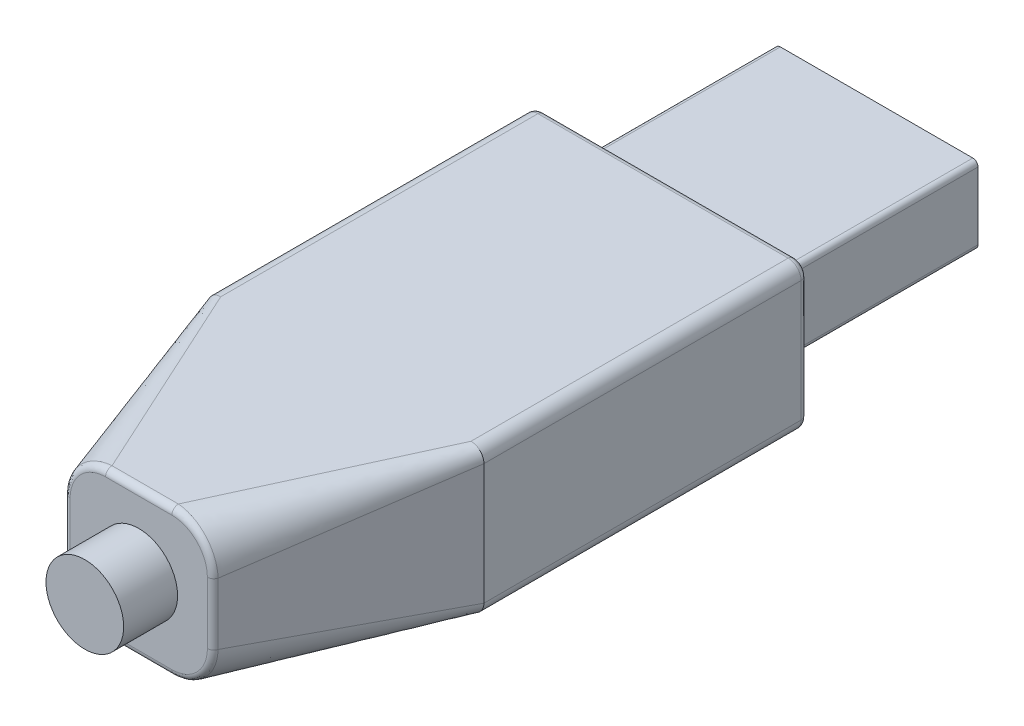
ISO-10303-21;
HEADER;
FILE_DESCRIPTION(('STEP AP214'),'2;1');
FILE_NAME('part.step','',(''),(''),'','','');
FILE_SCHEMA(('AUTOMOTIVE_DESIGN { 1 0 10303 214 1 1 1 1 }'));
ENDSEC;
DATA;
#1=APPLICATION_CONTEXT('core data for automotive mechanical design processes');
#2=APPLICATION_PROTOCOL_DEFINITION('international standard','automotive_design',2000,#1);
#3=PRODUCT_CONTEXT('',#1,'mechanical');
#4=PRODUCT('Part','Part','',(#3));
#5=PRODUCT_RELATED_PRODUCT_CATEGORY('part','',(#4));
#6=PRODUCT_DEFINITION_FORMATION('','',#4);
#7=PRODUCT_DEFINITION_CONTEXT('part definition',#1,'design');
#8=PRODUCT_DEFINITION('design','',#6,#7);
#9=PRODUCT_DEFINITION_SHAPE('','',#8);
#10=(LENGTH_UNIT() NAMED_UNIT(*) SI_UNIT(.MILLI.,.METRE.));
#11=(NAMED_UNIT(*) PLANE_ANGLE_UNIT() SI_UNIT($,.RADIAN.));
#12=(NAMED_UNIT(*) SI_UNIT($,.STERADIAN.) SOLID_ANGLE_UNIT());
#13=UNCERTAINTY_MEASURE_WITH_UNIT(LENGTH_MEASURE(1.E-05),#10,'distance_accuracy_value','');
#14=(GEOMETRIC_REPRESENTATION_CONTEXT(3) GLOBAL_UNCERTAINTY_ASSIGNED_CONTEXT((#13)) GLOBAL_UNIT_ASSIGNED_CONTEXT((#10,
#11,#12)) REPRESENTATION_CONTEXT('',''));
#15=CARTESIAN_POINT('',(0.,0.,0.));
#16=DIRECTION('',(0.,0.,1.));
#17=DIRECTION('',(1.,0.,0.));
#18=AXIS2_PLACEMENT_3D('',#15,#16,#17);
#19=CARTESIAN_POINT('',(-121.66605762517,19.7354233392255,67.1829999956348));
#20=DIRECTION('',(0.,-2.21185742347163E-10,-1.));
#21=DIRECTION('',(0.,1.,-2.21185742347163E-10));
#22=AXIS2_PLACEMENT_3D('',#19,#20,#21);
#23=PLANE('',#22);
#24=CARTESIAN_POINT('',(-121.66605762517,19.7354233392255,67.1829999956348));
#25=DIRECTION('',(0.,-2.21185742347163E-10,-1.));
#26=DIRECTION('',(0.,1.,-2.21185742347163E-10));
#27=AXIS2_PLACEMENT_3D('',#24,#25,#26);
#28=CIRCLE('',#27,0.381000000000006);
#29=CARTESIAN_POINT('',(-122.04705762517,19.7354233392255,67.1829999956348));
#30=VERTEX_POINT('',#29);
#31=CARTESIAN_POINT('',(-121.66605762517,20.1164233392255,67.1829999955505));
#32=VERTEX_POINT('',#31);
#33=EDGE_CURVE('E612',#30,#32,#28,.T.);
#34=ORIENTED_EDGE('',*,*,#33,.T.);
#35=DIRECTION('',(1.,0.,0.));
#36=VECTOR('',#35,1.);
#37=CARTESIAN_POINT('',(-106.93405762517,20.1164233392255,67.1829999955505));
#38=LINE('',#37,#36);
#39=CARTESIAN_POINT('',(-106.93405762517,20.1164233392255,67.1829999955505));
#40=VERTEX_POINT('',#39);
#41=EDGE_CURVE('E626',#32,#40,#38,.T.);
#42=ORIENTED_EDGE('',*,*,#41,.T.);
#43=CARTESIAN_POINT('',(-106.93405762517,19.7354233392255,67.1829999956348));
#44=DIRECTION('',(0.,-2.21185742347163E-10,-1.));
#45=DIRECTION('',(0.,1.,-2.21185742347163E-10));
#46=AXIS2_PLACEMENT_3D('',#43,#44,#45);
#47=CIRCLE('',#46,0.381000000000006);
#48=CARTESIAN_POINT('',(-106.55305762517,19.7354233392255,67.1829999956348));
#49=VERTEX_POINT('',#48);
#50=EDGE_CURVE('E624',#40,#49,#47,.T.);
#51=ORIENTED_EDGE('',*,*,#50,.T.);
#52=DIRECTION('',(0.,-1.,2.21185742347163E-10));
#53=VECTOR('',#52,1.);
#54=CARTESIAN_POINT('',(-106.55305762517,12.6234233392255,67.1829999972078));
#55=LINE('',#54,#53);
#56=CARTESIAN_POINT('',(-106.55305762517,12.6234233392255,67.1829999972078));
#57=VERTEX_POINT('',#56);
#58=EDGE_CURVE('E622',#49,#57,#55,.T.);
#59=ORIENTED_EDGE('',*,*,#58,.T.);
#60=CARTESIAN_POINT('',(-106.93405762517,12.6234233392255,67.1829999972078));
#61=DIRECTION('',(0.,-2.21185742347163E-10,-1.));
#62=DIRECTION('',(0.,1.,-2.21185742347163E-10));
#63=AXIS2_PLACEMENT_3D('',#60,#61,#62);
#64=CIRCLE('',#63,0.381000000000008);
#65=CARTESIAN_POINT('',(-106.93405762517,12.2424233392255,67.1829999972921));
#66=VERTEX_POINT('',#65);
#67=EDGE_CURVE('E620',#57,#66,#64,.T.);
#68=ORIENTED_EDGE('',*,*,#67,.T.);
#69=DIRECTION('',(-1.,0.,0.));
#70=VECTOR('',#69,1.);
#71=CARTESIAN_POINT('',(-121.66605762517,12.2424233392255,67.1829999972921));
#72=LINE('',#71,#70);
#73=CARTESIAN_POINT('',(-121.66605762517,12.2424233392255,67.1829999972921));
#74=VERTEX_POINT('',#73);
#75=EDGE_CURVE('E618',#66,#74,#72,.T.);
#76=ORIENTED_EDGE('',*,*,#75,.T.);
#77=CARTESIAN_POINT('',(-121.66605762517,12.6234233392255,67.1829999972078));
#78=DIRECTION('',(0.,-2.21185742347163E-10,-1.));
#79=DIRECTION('',(0.,1.,-2.21185742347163E-10));
#80=AXIS2_PLACEMENT_3D('',#77,#78,#79);
#81=CIRCLE('',#80,0.380999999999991);
#82=CARTESIAN_POINT('',(-122.04705762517,12.6234233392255,67.1829999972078));
#83=VERTEX_POINT('',#82);
#84=EDGE_CURVE('E616',#74,#83,#81,.T.);
#85=ORIENTED_EDGE('',*,*,#84,.T.);
#86=DIRECTION('',(0.,1.,-2.21185742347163E-10));
#87=VECTOR('',#86,1.);
#88=CARTESIAN_POINT('',(-122.04705762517,19.7354233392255,67.1829999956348));
#89=LINE('',#88,#87);
#90=EDGE_CURVE('E614',#83,#30,#89,.T.);
#91=ORIENTED_EDGE('',*,*,#90,.T.);
#92=EDGE_LOOP('',(#34,#42,#51,#59,#68,#76,#85,#91));
#93=FACE_BOUND('',#92,.T.);
#94=DIRECTION('',(-1.,0.,0.));
#95=VECTOR('',#94,1.);
#96=CARTESIAN_POINT('',(-108.33105762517,13.8934233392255,67.1829999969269));
#97=LINE('',#96,#95);
#98=CARTESIAN_POINT('',(-108.63585762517,13.8934233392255,67.1829999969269));
#99=VERTEX_POINT('',#98);
#100=CARTESIAN_POINT('',(-119.96425762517,13.8934233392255,67.1829999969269));
#101=VERTEX_POINT('',#100);
#102=EDGE_CURVE('E289',#99,#101,#97,.T.);
#103=ORIENTED_EDGE('',*,*,#102,.F.);
#104=CARTESIAN_POINT('',(-108.63585762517,14.1982233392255,67.1829999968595));
#105=DIRECTION('',(0.,-2.21185742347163E-10,-1.));
#106=DIRECTION('',(0.,1.,-2.21185742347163E-10));
#107=AXIS2_PLACEMENT_3D('',#104,#105,#106);
#108=CIRCLE('',#107,0.3048);
#109=CARTESIAN_POINT('',(-108.33105762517,14.1982233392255,67.1829999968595));
#110=VERTEX_POINT('',#109);
#111=EDGE_CURVE('E43',#99,#110,#108,.F.);
#112=ORIENTED_EDGE('',*,*,#111,.T.);
#113=DIRECTION('',(0.,-1.,2.21185590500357E-10));
#114=VECTOR('',#113,1.);
#115=CARTESIAN_POINT('',(-108.33105762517,18.4654233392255,67.1829999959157));
#116=LINE('',#115,#114);
#117=CARTESIAN_POINT('',(-108.33105762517,18.1606233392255,67.1829999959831));
#118=VERTEX_POINT('',#117);
#119=EDGE_CURVE('E284',#118,#110,#116,.T.);
#120=ORIENTED_EDGE('',*,*,#119,.F.);
#121=CARTESIAN_POINT('',(-108.63585762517,18.1606233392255,67.1829999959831));
#122=DIRECTION('',(0.,-2.21185742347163E-10,-1.));
#123=DIRECTION('',(0.,1.,-2.21185742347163E-10));
#124=AXIS2_PLACEMENT_3D('',#121,#122,#123);
#125=CIRCLE('',#124,0.3048);
#126=CARTESIAN_POINT('',(-108.63585762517,18.4654233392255,67.1829999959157));
#127=VERTEX_POINT('',#126);
#128=EDGE_CURVE('E675',#118,#127,#125,.F.);
#129=ORIENTED_EDGE('',*,*,#128,.T.);
#130=DIRECTION('',(1.,0.,0.));
#131=VECTOR('',#130,1.);
#132=CARTESIAN_POINT('',(-108.33105762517,18.4654233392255,67.1829999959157));
#133=LINE('',#132,#131);
#134=CARTESIAN_POINT('',(-119.96425762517,18.4654233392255,67.1829999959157));
#135=VERTEX_POINT('',#134);
#136=EDGE_CURVE('E294',#135,#127,#133,.T.);
#137=ORIENTED_EDGE('',*,*,#136,.F.);
#138=CARTESIAN_POINT('',(-119.96425762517,18.1606233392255,67.1829999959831));
#139=DIRECTION('',(0.,-2.21185742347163E-10,-1.));
#140=DIRECTION('',(0.,1.,-2.21185742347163E-10));
#141=AXIS2_PLACEMENT_3D('',#138,#139,#140);
#142=CIRCLE('',#141,0.3048);
#143=CARTESIAN_POINT('',(-120.26905762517,18.1606233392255,67.1829999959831));
#144=VERTEX_POINT('',#143);
#145=EDGE_CURVE('E673',#135,#144,#142,.F.);
#146=ORIENTED_EDGE('',*,*,#145,.T.);
#147=DIRECTION('',(0.,1.,-2.21185590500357E-10));
#148=VECTOR('',#147,1.);
#149=CARTESIAN_POINT('',(-120.26905762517,18.4654233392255,67.1829999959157));
#150=LINE('',#149,#148);
#151=CARTESIAN_POINT('',(-120.26905762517,14.1982233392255,67.1829999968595));
#152=VERTEX_POINT('',#151);
#153=EDGE_CURVE('E291',#152,#144,#150,.T.);
#154=ORIENTED_EDGE('',*,*,#153,.F.);
#155=CARTESIAN_POINT('',(-119.96425762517,14.1982233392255,67.1829999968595));
#156=DIRECTION('',(0.,-2.21185742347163E-10,-1.));
#157=DIRECTION('',(0.,1.,-2.21185742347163E-10));
#158=AXIS2_PLACEMENT_3D('',#155,#156,#157);
#159=CIRCLE('',#158,0.3048);
#160=EDGE_CURVE('E11',#152,#101,#159,.F.);
#161=ORIENTED_EDGE('',*,*,#160,.T.);
#162=EDGE_LOOP('',(#103,#112,#120,#129,#137,#146,#154,#161));
#163=FACE_BOUND('',#162,.T.);
#164=ADVANCED_FACE('F34',(#93,#163),#23,.T.);
#165=CARTESIAN_POINT('',(-114.30005762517,16.1794233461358,98.4249999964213));
#166=DIRECTION('',(0.,2.21185742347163E-10,1.));
#167=DIRECTION('',(0.,-1.,2.21185742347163E-10));
#168=AXIS2_PLACEMENT_3D('',#165,#166,#167);
#169=CYLINDRICAL_SURFACE('',#168,2.28599999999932);
#170=CARTESIAN_POINT('',(-114.30005762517,16.1794233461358,98.4249999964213));
#171=DIRECTION('',(0.,2.21185742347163E-10,1.));
#172=DIRECTION('',(0.,-1.,2.21185742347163E-10));
#173=AXIS2_PLACEMENT_3D('',#170,#171,#172);
#174=CIRCLE('',#173,2.28599999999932);
#175=CARTESIAN_POINT('',(-114.30005762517,13.8934233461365,98.4249999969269));
#176=VERTEX_POINT('',#175);
#177=EDGE_CURVE('E365',#176,#176,#174,.T.);
#178=ORIENTED_EDGE('',*,*,#177,.T.);
#179=EDGE_LOOP('',(#178));
#180=FACE_BOUND('',#179,.T.);
#181=CARTESIAN_POINT('',(-114.30005762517,16.1794233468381,101.599999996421));
#182=DIRECTION('',(0.,2.21185742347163E-10,1.));
#183=DIRECTION('',(0.,-1.,2.21185742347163E-10));
#184=AXIS2_PLACEMENT_3D('',#181,#182,#183);
#185=CIRCLE('',#184,2.28599999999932);
#186=CARTESIAN_POINT('',(-114.30005762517,13.8934233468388,101.599999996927));
#187=VERTEX_POINT('',#186);
#188=EDGE_CURVE('E368',#187,#187,#185,.T.);
#189=ORIENTED_EDGE('',*,*,#188,.F.);
#190=EDGE_LOOP('',(#189));
#191=FACE_BOUND('',#190,.T.);
#192=ADVANCED_FACE('F537',(#180,#191),#169,.T.);
#193=CARTESIAN_POINT('',(-114.30005762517,16.1794233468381,101.599999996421));
#194=DIRECTION('',(0.,2.21185742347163E-10,1.));
#195=DIRECTION('',(0.,-1.,2.21185742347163E-10));
#196=AXIS2_PLACEMENT_3D('',#193,#194,#195);
#197=PLANE('',#196);
#198=ORIENTED_EDGE('',*,*,#188,.T.);
#199=EDGE_LOOP('',(#198));
#200=FACE_BOUND('',#199,.T.);
#201=ADVANCED_FACE('F913',(#200),#197,.T.);
#202=CARTESIAN_POINT('',(-112.52205762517,17.9574233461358,98.424999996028));
#203=DIRECTION('',(0.,-2.21185742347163E-10,-1.));
#204=DIRECTION('',(0.,1.,-2.21185742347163E-10));
#205=AXIS2_PLACEMENT_3D('',#202,#203,#204);
#206=PLANE('',#205);
#207=DIRECTION('',(0.,-1.,2.21185742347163E-10));
#208=VECTOR('',#207,1.);
#209=CARTESIAN_POINT('',(-110.262165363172,17.9574233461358,98.424999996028));
#210=LINE('',#209,#208);
#211=CARTESIAN_POINT('',(-110.262165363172,14.3624337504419,98.4249999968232));
#212=VERTEX_POINT('',#211);
#213=CARTESIAN_POINT('',(-110.262165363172,17.9964129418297,98.4249999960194));
#214=VERTEX_POINT('',#213);
#215=EDGE_CURVE('E785',#212,#214,#210,.F.);
#216=ORIENTED_EDGE('',*,*,#215,.T.);
#217=CARTESIAN_POINT('',(-109.89850849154,17.1079177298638,98.1576427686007));
#218=CARTESIAN_POINT('',(-109.98205762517,17.1079177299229,98.4249999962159));
#219=CARTESIAN_POINT('',(-110.262165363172,17.107917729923,98.4249999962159));
#220=CARTESIAN_POINT('',(-109.89850849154,17.4040828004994,98.1576427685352));
#221=CARTESIAN_POINT('',(-109.98205762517,17.4040828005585,98.4249999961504));
#222=CARTESIAN_POINT('',(-110.262165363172,17.4040828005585,98.4249999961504));
#223=CARTESIAN_POINT('',(-109.89850849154,17.700247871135,98.1576427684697));
#224=CARTESIAN_POINT('',(-109.98205762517,17.7002478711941,98.4249999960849));
#225=CARTESIAN_POINT('',(-110.262165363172,17.7002478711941,98.4249999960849));
#226=CARTESIAN_POINT('',(-109.89850849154,17.9964129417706,98.1576427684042));
#227=CARTESIAN_POINT('',(-109.98205762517,17.9964129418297,98.4249999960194));
#228=CARTESIAN_POINT('',(-110.262165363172,17.9964129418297,98.4249999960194));
#229=CARTESIAN_POINT('',(-109.899285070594,18.1372341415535,98.1603657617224));
#230=CARTESIAN_POINT('',(-109.984080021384,18.1321537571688,98.4249999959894));
#231=CARTESIAN_POINT('',(-110.262074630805,18.1166982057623,98.4249999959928));
#232=CARTESIAN_POINT('',(-109.911929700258,18.2778040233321,98.1623353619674));
#233=CARTESIAN_POINT('',(-109.997299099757,18.2679985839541,98.4249999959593));
#234=CARTESIAN_POINT('',(-110.272347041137,18.2369452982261,98.4249999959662));
#235=CARTESIAN_POINT('',(-109.960047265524,18.5547707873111,98.164782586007));
#236=CARTESIAN_POINT('',(-110.044969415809,18.5351879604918,98.4249999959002));
#237=CARTESIAN_POINT('',(-110.312835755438,18.4739576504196,98.4249999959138));
#238=CARTESIAN_POINT('',(-109.995505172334,18.6911703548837,98.1652611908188));
#239=CARTESIAN_POINT('',(-110.07942588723,18.6669443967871,98.4249999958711));
#240=CARTESIAN_POINT('',(-110.343038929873,18.5907251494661,98.4249999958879));
#241=CARTESIAN_POINT('',(-110.08836327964,18.956373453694,98.1647446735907));
#242=CARTESIAN_POINT('',(-110.168805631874,18.9230003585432,98.4249999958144));
#243=CARTESIAN_POINT('',(-110.422624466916,18.8175848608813,98.4249999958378));
#244=CARTESIAN_POINT('',(-110.145772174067,19.0851739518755,98.163748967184));
#245=CARTESIAN_POINT('',(-110.223878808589,19.0476689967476,98.4249999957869));
#246=CARTESIAN_POINT('',(-110.472014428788,18.9276744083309,98.4249999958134));
#247=CARTESIAN_POINT('',(-110.281100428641,19.3316901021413,98.1602612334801));
#248=CARTESIAN_POINT('',(-110.353080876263,19.2865579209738,98.424999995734));
#249=CARTESIAN_POINT('',(-110.588572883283,19.1379790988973,98.4249999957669));
#250=CARTESIAN_POINT('',(-110.359016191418,19.4494076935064,98.1577694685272));
#251=CARTESIAN_POINT('',(-110.427468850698,19.4011049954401,98.4249999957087));
#252=CARTESIAN_POINT('',(-110.655738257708,19.238195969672,98.4249999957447));
#253=CARTESIAN_POINT('',(-110.533461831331,19.6703982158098,98.1512508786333));
#254=CARTESIAN_POINT('',(-110.593542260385,19.6169283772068,98.424999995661));
#255=CARTESIAN_POINT('',(-110.805960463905,19.4257790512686,98.4249999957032));
#256=CARTESIAN_POINT('',(-110.629975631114,19.7736834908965,98.1472253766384));
#257=CARTESIAN_POINT('',(-110.685595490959,19.7184750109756,98.4249999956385));
#258=CARTESIAN_POINT('',(-110.889003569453,19.5131562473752,98.4249999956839));
#259=CARTESIAN_POINT('',(-110.839384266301,19.9628124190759,98.1375956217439));
#260=CARTESIAN_POINT('',(-110.885022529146,19.9058997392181,98.424999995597));
#261=CARTESIAN_POINT('',(-111.068760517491,19.67255219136,98.4249999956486));
#262=CARTESIAN_POINT('',(-110.952282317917,20.0486526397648,98.1319910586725));
#263=CARTESIAN_POINT('',(-110.992901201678,19.9919409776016,98.424999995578));
#264=CARTESIAN_POINT('',(-111.16547704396,19.7445679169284,98.4249999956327));
#265=CARTESIAN_POINT('',(-111.190167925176,20.1990336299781,98.1192790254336));
#266=CARTESIAN_POINT('',(-111.22022289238,20.1451150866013,98.4249999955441));
#267=CARTESIAN_POINT('',(-111.368639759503,19.8702010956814,98.4249999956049));
#268=CARTESIAN_POINT('',(-111.314999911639,20.2638101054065,98.1121897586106));
#269=CARTESIAN_POINT('',(-111.340126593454,20.2125031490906,98.4249999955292));
#270=CARTESIAN_POINT('',(-111.47495995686,19.9240224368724,98.424999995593));
#271=CARTESIAN_POINT('',(-111.574416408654,20.3708322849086,98.0965663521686));
#272=CARTESIAN_POINT('',(-111.589906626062,20.3276728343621,98.4249999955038));
#273=CARTESIAN_POINT('',(-111.695216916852,20.0125974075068,98.4249999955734));
#274=CARTESIAN_POINT('',(-111.70899141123,20.4130996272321,98.0880336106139));
#275=CARTESIAN_POINT('',(-111.720434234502,20.3753423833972,98.4249999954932));
#276=CARTESIAN_POINT('',(-111.809146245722,20.0473693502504,98.4249999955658));
#277=CARTESIAN_POINT('',(-111.928525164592,20.4610979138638,98.073453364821));
#278=CARTESIAN_POINT('',(-111.933650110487,20.4342849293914,98.4249999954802));
#279=CARTESIAN_POINT('',(-111.994552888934,20.086748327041,98.4249999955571));
#280=CARTESIAN_POINT('',(-112.011712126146,20.4746845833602,98.0677834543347));
#281=CARTESIAN_POINT('',(-112.015248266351,20.4525469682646,98.4249999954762));
#282=CARTESIAN_POINT('',(-112.064709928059,20.0978612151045,98.4249999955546));
#283=CARTESIAN_POINT('',(-112.179050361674,20.4928481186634,98.0561165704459));
#284=CARTESIAN_POINT('',(-112.180304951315,20.4811360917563,98.4249999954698));
#285=CARTESIAN_POINT('',(-112.20570980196,20.1126973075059,98.4249999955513));
#286=CARTESIAN_POINT('',(-112.263200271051,20.4974364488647,98.0501200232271));
#287=CARTESIAN_POINT('',(-112.263888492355,20.4913731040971,98.4249999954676));
#288=CARTESIAN_POINT('',(-112.276551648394,20.1164299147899,98.4249999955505));
#289=CARTESIAN_POINT('',(-112.347432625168,20.4974233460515,98.0439999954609));
#290=CARTESIAN_POINT('',(-112.347432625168,20.4974233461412,98.4249999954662));
#291=CARTESIAN_POINT('',(-112.34743262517,20.1164233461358,98.4249999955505));
#292=CARTESIAN_POINT('',(-112.849274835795,20.4974233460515,98.0439999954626));
#293=CARTESIAN_POINT('',(-112.849274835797,20.4974233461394,98.4249999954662));
#294=CARTESIAN_POINT('',(-112.849274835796,20.1164233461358,98.4249999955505));
#295=CARTESIAN_POINT('',(-113.351117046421,20.4974233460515,98.0439999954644));
#296=CARTESIAN_POINT('',(-113.351117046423,20.4974233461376,98.4249999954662));
#297=CARTESIAN_POINT('',(-113.351117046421,20.1164233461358,98.4249999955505));
#298=CARTESIAN_POINT('',(-113.852959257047,20.4974233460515,98.0439999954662));
#299=CARTESIAN_POINT('',(-113.852959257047,20.4974233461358,98.4249999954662));
#300=CARTESIAN_POINT('',(-113.852959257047,20.1164233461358,98.4249999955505));
#301=(BOUNDED_SURFACE() B_SPLINE_SURFACE(3,2,((#217,#218,#219),(#220,#221,#222),(#223,#224,
#225),(#226,#227,#228),(#229,#230,#231),(#232,#233,#234),(#235,#236,#237),(#238,#239,#240),
(#241,#242,#243),(#244,#245,#246),(#247,#248,#249),(#250,#251,#252),(#253,#254,#255),(#256,#257,
#258),(#259,#260,#261),(#262,#263,#264),(#265,#266,#267),(#268,#269,#270),(#271,#272,#273),
(#274,#275,#276),(#277,#278,#279),(#280,#281,#282),(#283,#284,#285),(#286,#287,#288),(#289,#290,
#291),(#292,#293,#294),(#295,#296,#297),(#298,#299,#300)),.UNSPECIFIED.,.F.,.F.,
.F.) B_SPLINE_SURFACE_WITH_KNOTS((4,3,2,2,2,2,2,2,2,2,2,3,4),(3,3),(0.,0.888495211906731,
1.2488600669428,1.60898776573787,1.96925824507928,2.32946556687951,2.68936288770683,
3.04933095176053,3.40511997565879,3.7605663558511,3.97330757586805,4.18577757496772,
5.69130420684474),(0.,1.),
.UNSPECIFIED.) GEOMETRIC_REPRESENTATION_ITEM() RATIONAL_B_SPLINE_SURFACE(((1.,0.805690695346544,
1.),(1.,0.805690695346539,1.),(1.,0.805690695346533,1.),(1.,0.805690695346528,1.),(1.,
0.807905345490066,1.),(1.,0.80950321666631,1.),(1.,0.811486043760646,1.),(1.,0.811871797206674,
1.),(1.,0.811453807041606,1.),(1.,0.810649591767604,1.),(1.,0.80782171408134,1.),(1.,
0.805798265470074,1.),(1.,0.800472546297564,1.),(1.,0.797171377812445,1.),(1.,0.789205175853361,
1.),(1.,0.784539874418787,1.),(1.,0.773834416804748,1.),(1.,0.767810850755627,1.),(1.,
0.754340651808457,1.),(1.,0.746895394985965,1.),(1.,0.733945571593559,1.),(1.,0.728861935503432,
1.),(1.,0.718282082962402,1.),(1.,0.712786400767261,1.),(1.,0.70710678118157,1.),(1.,
0.707106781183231,1.),(1.,0.707106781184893,1.),(1.,0.707106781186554,1.))) REPRESENTATION_ITEM('') SURFACE());
#302=CARTESIAN_POINT('',(-110.262165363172,17.107917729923,98.4249999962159));
#303=CARTESIAN_POINT('',(-110.262165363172,17.4040828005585,98.4249999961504));
#304=CARTESIAN_POINT('',(-110.262165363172,17.7002478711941,98.4249999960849));
#305=CARTESIAN_POINT('',(-110.262165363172,17.9964129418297,98.4249999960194));
#306=CARTESIAN_POINT('',(-110.262074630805,18.1166982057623,98.4249999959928));
#307=CARTESIAN_POINT('',(-110.272347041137,18.2369452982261,98.4249999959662));
#308=CARTESIAN_POINT('',(-110.312835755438,18.4739576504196,98.4249999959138));
#309=CARTESIAN_POINT('',(-110.343038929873,18.5907251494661,98.424999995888));
#310=CARTESIAN_POINT('',(-110.422624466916,18.8175848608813,98.4249999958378));
#311=CARTESIAN_POINT('',(-110.472014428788,18.9276744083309,98.4249999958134));
#312=CARTESIAN_POINT('',(-110.588572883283,19.1379790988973,98.4249999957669));
#313=CARTESIAN_POINT('',(-110.655738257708,19.238195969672,98.4249999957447));
#314=CARTESIAN_POINT('',(-110.805960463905,19.4257790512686,98.4249999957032));
#315=CARTESIAN_POINT('',(-110.889003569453,19.5131562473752,98.4249999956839));
#316=CARTESIAN_POINT('',(-111.068760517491,19.67255219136,98.4249999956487));
#317=CARTESIAN_POINT('',(-111.16547704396,19.7445679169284,98.4249999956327));
#318=CARTESIAN_POINT('',(-111.368639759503,19.8702010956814,98.4249999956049));
#319=CARTESIAN_POINT('',(-111.47495995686,19.9240224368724,98.424999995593));
#320=CARTESIAN_POINT('',(-111.695216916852,20.0125974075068,98.4249999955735));
#321=CARTESIAN_POINT('',(-111.809146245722,20.0473693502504,98.4249999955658));
#322=CARTESIAN_POINT('',(-111.994552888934,20.086748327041,98.4249999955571));
#323=CARTESIAN_POINT('',(-112.064709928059,20.0978612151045,98.4249999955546));
#324=CARTESIAN_POINT('',(-112.20570980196,20.1126973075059,98.4249999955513));
#325=CARTESIAN_POINT('',(-112.276551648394,20.1164299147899,98.4249999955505));
#326=CARTESIAN_POINT('',(-112.34743262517,20.1164233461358,98.4249999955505));
#327=CARTESIAN_POINT('',(-112.849274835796,20.1164233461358,98.4249999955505));
#328=CARTESIAN_POINT('',(-113.351117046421,20.1164233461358,98.4249999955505));
#329=CARTESIAN_POINT('',(-113.852959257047,20.1164233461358,98.4249999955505));
#330=B_SPLINE_CURVE_WITH_KNOTS('',3,(#302,#303,#304,#305,#306,#307,#308,#309,#310,#311,#312,
#313,#314,#315,#316,#317,#318,#319,#320,#321,#322,#323,#324,#325,#326,#327,#328,#329),
.UNSPECIFIED.,.F.,.F.,(4,3,2,2,2,2,2,2,2,2,2,3,4),(0.,0.888495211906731,1.2488600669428,
1.60898776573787,1.96925824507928,2.32946556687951,2.68936288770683,3.04933095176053,
3.40511997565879,3.7605663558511,3.97330757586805,4.18577757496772,5.69130420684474),.UNSPECIFIED.);
#331=CARTESIAN_POINT('',(-112.34743262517,20.1164233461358,98.4249999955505));
#332=VERTEX_POINT('',#331);
#333=EDGE_CURVE('E781',#214,#332,#330,.T.);
#334=ORIENTED_EDGE('',*,*,#333,.T.);
#335=DIRECTION('',(1.,0.,0.));
#336=VECTOR('',#335,1.);
#337=CARTESIAN_POINT('',(-112.52205762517,20.1164233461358,98.4249999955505));
#338=LINE('',#337,#336);
#339=CARTESIAN_POINT('',(-116.25268262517,20.1164233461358,98.4249999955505));
#340=VERTEX_POINT('',#339);
#341=EDGE_CURVE('E797',#332,#340,#338,.F.);
#342=ORIENTED_EDGE('',*,*,#341,.T.);
#343=CARTESIAN_POINT('',(-114.647069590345,20.4974233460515,98.0439999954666));
#344=CARTESIAN_POINT('',(-114.647069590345,20.4974233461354,98.4249999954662));
#345=CARTESIAN_POINT('',(-114.647069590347,20.1164233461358,98.4249999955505));
#346=CARTESIAN_POINT('',(-115.182273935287,20.4974233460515,98.0439999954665));
#347=CARTESIAN_POINT('',(-115.182273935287,20.4974233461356,98.4249999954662));
#348=CARTESIAN_POINT('',(-115.182273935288,20.1164233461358,98.4249999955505));
#349=CARTESIAN_POINT('',(-115.717478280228,20.4974233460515,98.0439999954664));
#350=CARTESIAN_POINT('',(-115.717478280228,20.4974233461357,98.4249999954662));
#351=CARTESIAN_POINT('',(-115.717478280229,20.1164233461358,98.4249999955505));
#352=CARTESIAN_POINT('',(-116.25268262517,20.4974233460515,98.0439999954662));
#353=CARTESIAN_POINT('',(-116.25268262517,20.4974233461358,98.4249999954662));
#354=CARTESIAN_POINT('',(-116.25268262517,20.1164233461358,98.4249999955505));
#355=CARTESIAN_POINT('',(-116.320664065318,20.4974259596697,98.0489380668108));
#356=CARTESIAN_POINT('',(-116.320220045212,20.4925218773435,98.4249999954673));
#357=CARTESIAN_POINT('',(-116.309890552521,20.1164236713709,98.4249999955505));
#358=CARTESIAN_POINT('',(-116.38859142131,20.4944424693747,98.0537972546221));
#359=CARTESIAN_POINT('',(-116.38776665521,20.4849008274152,98.424999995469));
#360=CARTESIAN_POINT('',(-116.367070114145,20.1139957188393,98.424999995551));
#361=CARTESIAN_POINT('',(-116.523864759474,20.4826005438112,98.0633095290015));
#362=CARTESIAN_POINT('',(-116.521516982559,20.4643506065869,98.4249999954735));
#363=CARTESIAN_POINT('',(-116.481012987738,20.1043293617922,98.4249999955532));
#364=CARTESIAN_POINT('',(-116.591210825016,20.473742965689,98.0679626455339));
#365=CARTESIAN_POINT('',(-116.587785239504,20.4514778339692,98.4249999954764));
#366=CARTESIAN_POINT('',(-116.537776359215,20.0970916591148,98.4249999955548));
#367=CARTESIAN_POINT('',(-116.791379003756,20.4385595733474,98.0815209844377));
#368=CARTESIAN_POINT('',(-116.782752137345,20.4054454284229,98.4249999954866));
#369=CARTESIAN_POINT('',(-116.706659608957,20.0682778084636,98.4249999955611));
#370=CARTESIAN_POINT('',(-116.922659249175,20.4036221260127,98.0900491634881));
#371=CARTESIAN_POINT('',(-116.910494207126,20.3645957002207,98.4249999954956));
#372=CARTESIAN_POINT('',(-116.817648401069,20.0396004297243,98.4249999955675));
#373=CARTESIAN_POINT('',(-117.177517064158,20.3122225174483,98.1058391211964));
#374=CARTESIAN_POINT('',(-117.156587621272,20.2638446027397,98.4249999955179));
#375=CARTESIAN_POINT('',(-117.033701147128,19.9641421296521,98.4249999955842));
#376=CARTESIAN_POINT('',(-117.301062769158,20.2556773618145,98.1130958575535));
#377=CARTESIAN_POINT('',(-117.275509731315,20.2040322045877,98.4249999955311));
#378=CARTESIAN_POINT('',(-117.138740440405,19.9172913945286,98.4249999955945));
#379=CARTESIAN_POINT('',(-117.536788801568,20.1232394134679,98.126189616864));
#380=CARTESIAN_POINT('',(-117.501189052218,20.0674188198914,98.4249999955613));
#381=CARTESIAN_POINT('',(-117.339708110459,19.8069604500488,98.4249999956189));
#382=CARTESIAN_POINT('',(-117.648967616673,20.0473440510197,98.132026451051));
#383=CARTESIAN_POINT('',(-117.608497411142,19.9906255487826,98.4249999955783));
#384=CARTESIAN_POINT('',(-117.435635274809,19.7434780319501,98.424999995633));
#385=CARTESIAN_POINT('',(-117.861417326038,19.8769682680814,98.1423610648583));
#386=CARTESIAN_POINT('',(-117.810962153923,19.8205206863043,98.4249999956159));
#387=CARTESIAN_POINT('',(-117.617711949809,19.6002996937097,98.4249999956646));
#388=CARTESIAN_POINT('',(-117.961398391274,19.782140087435,98.1468290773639));
#389=CARTESIAN_POINT('',(-117.906342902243,19.7267692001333,98.4249999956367));
#390=CARTESIAN_POINT('',(-117.703621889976,19.5202992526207,98.4249999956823));
#391=CARTESIAN_POINT('',(-118.144437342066,19.5777519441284,98.1542928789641));
#392=CARTESIAN_POINT('',(-118.080561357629,19.5262793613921,98.424999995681));
#393=CARTESIAN_POINT('',(-117.861103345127,19.347228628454,98.4249999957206));
#394=CARTESIAN_POINT('',(-118.227491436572,19.468188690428,98.1572883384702));
#395=CARTESIAN_POINT('',(-118.159790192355,19.4193272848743,98.4249999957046));
#396=CARTESIAN_POINT('',(-117.932671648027,19.2541555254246,98.4249999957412));
#397=CARTESIAN_POINT('',(-118.376156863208,19.2352069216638,98.1618899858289));
#398=CARTESIAN_POINT('',(-118.301493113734,19.1929992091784,98.4249999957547));
#399=CARTESIAN_POINT('',(-118.060764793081,19.0557401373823,98.4249999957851));
#400=CARTESIAN_POINT('',(-118.44141912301,19.1115705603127,98.1634695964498));
#401=CARTESIAN_POINT('',(-118.363937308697,19.0731303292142,98.4249999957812));
#402=CARTESIAN_POINT('',(-118.116988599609,18.9502036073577,98.4249999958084));
#403=CARTESIAN_POINT('',(-118.550898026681,18.8554215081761,98.1651733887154));
#404=CARTESIAN_POINT('',(-118.468867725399,18.8255445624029,98.424999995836));
#405=CARTESIAN_POINT('',(-118.211090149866,18.7312673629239,98.4249999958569));
#406=CARTESIAN_POINT('',(-118.595123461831,18.7229125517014,98.1652981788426));
#407=CARTESIAN_POINT('',(-118.511548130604,18.6974856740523,98.4249999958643));
#408=CARTESIAN_POINT('',(-118.248975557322,18.6178709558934,98.4249999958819));
#409=CARTESIAN_POINT('',(-118.651984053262,18.4910397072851,98.1642690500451));
#410=CARTESIAN_POINT('',(-118.566900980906,18.4738264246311,98.4249999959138));
#411=CARTESIAN_POINT('',(-118.297336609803,18.419424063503,98.4249999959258));
#412=CARTESIAN_POINT('',(-118.67002835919,18.3929801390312,98.1634690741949));
#413=CARTESIAN_POINT('',(-118.584695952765,18.379170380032,98.4249999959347));
#414=CARTESIAN_POINT('',(-118.312545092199,18.3354950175,98.4249999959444));
#415=CARTESIAN_POINT('',(-118.69453618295,18.1954662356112,98.1611194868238));
#416=CARTESIAN_POINT('',(-118.609510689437,18.1885757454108,98.4249999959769));
#417=CARTESIAN_POINT('',(-118.332852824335,18.1665267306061,98.4249999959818));
#418=CARTESIAN_POINT('',(-118.701013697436,18.0960137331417,98.1595707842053));
#419=CARTESIAN_POINT('',(-118.616536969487,18.0924910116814,98.4249999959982));
#420=CARTESIAN_POINT('',(-118.337964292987,18.0814889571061,98.4249999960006));
#421=CARTESIAN_POINT('',(-118.701606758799,17.9964129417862,98.1576427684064));
#422=CARTESIAN_POINT('',(-118.618057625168,17.9964129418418,98.4249999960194));
#423=CARTESIAN_POINT('',(-118.337949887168,17.9964129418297,98.4249999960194));
#424=CARTESIAN_POINT('',(-118.701606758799,17.4612085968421,98.1576427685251));
#425=CARTESIAN_POINT('',(-118.618057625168,17.461208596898,98.4249999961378));
#426=CARTESIAN_POINT('',(-118.337949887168,17.4612085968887,98.4249999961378));
#427=CARTESIAN_POINT('',(-118.701606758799,16.926004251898,98.1576427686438));
#428=CARTESIAN_POINT('',(-118.618057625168,16.9260042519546,98.4249999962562));
#429=CARTESIAN_POINT('',(-118.337949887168,16.9260042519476,98.4249999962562));
#430=CARTESIAN_POINT('',(-118.701606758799,16.390799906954,98.1576427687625));
#431=CARTESIAN_POINT('',(-118.618057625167,16.3907999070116,98.4249999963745));
#432=CARTESIAN_POINT('',(-118.337949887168,16.3907999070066,98.4249999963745));
#433=(BOUNDED_SURFACE() B_SPLINE_SURFACE(3,2,((#343,#344,#345),(#346,#347,#348),(#349,#350,
#351),(#352,#353,#354),(#355,#356,#357),(#358,#359,#360),(#361,#362,#363),(#364,#365,#366),
(#367,#368,#369),(#370,#371,#372),(#373,#374,#375),(#376,#377,#378),(#379,#380,#381),(#382,#383,
#384),(#385,#386,#387),(#388,#389,#390),(#391,#392,#393),(#394,#395,#396),(#397,#398,#399),
(#400,#401,#402),(#403,#404,#405),(#406,#407,#408),(#409,#410,#411),(#412,#413,#414),(#415,#416,
#417),(#418,#419,#420),(#421,#422,#423),(#424,#425,#426),(#427,#428,#429),(#430,#431,#432)),
.UNSPECIFIED.,.F.,.F.,.F.) B_SPLINE_SURFACE_WITH_KNOTS((4,3,2,2,2,2,2,2,2,2,2,2,3,4),(3,3),(0.,
1.60561303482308,1.77712988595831,1.94862171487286,2.29078855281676,2.63428307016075,
2.97782322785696,3.32837625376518,3.67900770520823,4.03609089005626,4.39302471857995,
4.64833672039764,4.90333956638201,6.5089526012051),(0.,1.),
.UNSPECIFIED.) GEOMETRIC_REPRESENTATION_ITEM() RATIONAL_B_SPLINE_SURFACE(((1.,0.707106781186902,
1.),(1.,0.707106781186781,1.),(1.,0.707106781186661,1.),(1.,0.707106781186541,1.),(1.,
0.71168934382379,1.),(1.,0.716153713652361,1.),(1.,0.724816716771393,1.),(1.,0.729015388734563,
1.),(1.,0.741151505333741,1.),(1.,0.74865114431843,1.),(1.,0.762365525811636,1.),(1.,
0.768575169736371,1.),(1.,0.779673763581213,1.),(1.,0.784562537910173,1.),(1.,0.793159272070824,
1.),(1.,0.796841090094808,1.),(1.,0.802963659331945,1.),(1.,0.805404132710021,1.),(1.,
0.809144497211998,1.),(1.,0.81042257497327,1.),(1.,0.811800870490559,1.),(1.,0.811901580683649,
1.),(1.,0.8110693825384,1.),(1.,0.810422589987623,1.),(1.,0.808517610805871,1.),(1.,
0.807260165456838,1.),(1.,0.805690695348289,1.),(1.,0.805690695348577,1.),(1.,0.805690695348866,
1.),(1.,0.805690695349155,1.))) REPRESENTATION_ITEM('') SURFACE());
#434=CARTESIAN_POINT('',(-114.647069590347,20.1164233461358,98.4249999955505));
#435=CARTESIAN_POINT('',(-115.182273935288,20.1164233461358,98.4249999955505));
#436=CARTESIAN_POINT('',(-115.717478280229,20.1164233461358,98.4249999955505));
#437=CARTESIAN_POINT('',(-116.25268262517,20.1164233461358,98.4249999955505));
#438=CARTESIAN_POINT('',(-116.309890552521,20.1164236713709,98.4249999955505));
#439=CARTESIAN_POINT('',(-116.367070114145,20.1139957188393,98.424999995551));
#440=CARTESIAN_POINT('',(-116.481012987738,20.1043293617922,98.4249999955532));
#441=CARTESIAN_POINT('',(-116.537776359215,20.0970916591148,98.4249999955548));
#442=CARTESIAN_POINT('',(-116.706659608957,20.0682778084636,98.4249999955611));
#443=CARTESIAN_POINT('',(-116.817648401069,20.0396004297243,98.4249999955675));
#444=CARTESIAN_POINT('',(-117.033701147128,19.9641421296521,98.4249999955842));
#445=CARTESIAN_POINT('',(-117.138740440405,19.9172913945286,98.4249999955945));
#446=CARTESIAN_POINT('',(-117.339708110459,19.8069604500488,98.4249999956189));
#447=CARTESIAN_POINT('',(-117.435635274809,19.7434780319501,98.424999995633));
#448=CARTESIAN_POINT('',(-117.617711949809,19.6002996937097,98.4249999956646));
#449=CARTESIAN_POINT('',(-117.703621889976,19.5202992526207,98.4249999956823));
#450=CARTESIAN_POINT('',(-117.861103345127,19.347228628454,98.4249999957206));
#451=CARTESIAN_POINT('',(-117.932671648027,19.2541555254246,98.4249999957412));
#452=CARTESIAN_POINT('',(-118.060764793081,19.0557401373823,98.4249999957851));
#453=CARTESIAN_POINT('',(-118.116988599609,18.9502036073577,98.4249999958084));
#454=CARTESIAN_POINT('',(-118.211090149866,18.7312673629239,98.4249999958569));
#455=CARTESIAN_POINT('',(-118.248975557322,18.6178709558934,98.4249999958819));
#456=CARTESIAN_POINT('',(-118.297336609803,18.419424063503,98.4249999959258));
#457=CARTESIAN_POINT('',(-118.312545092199,18.3354950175,98.4249999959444));
#458=CARTESIAN_POINT('',(-118.332852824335,18.1665267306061,98.4249999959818));
#459=CARTESIAN_POINT('',(-118.337964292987,18.0814889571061,98.4249999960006));
#460=CARTESIAN_POINT('',(-118.337949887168,17.9964129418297,98.4249999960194));
#461=CARTESIAN_POINT('',(-118.337949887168,17.4612085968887,98.4249999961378));
#462=CARTESIAN_POINT('',(-118.337949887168,16.9260042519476,98.4249999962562));
#463=CARTESIAN_POINT('',(-118.337949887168,16.3907999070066,98.4249999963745));
#464=B_SPLINE_CURVE_WITH_KNOTS('',3,(#434,#435,#436,#437,#438,#439,#440,#441,#442,#443,#444,
#445,#446,#447,#448,#449,#450,#451,#452,#453,#454,#455,#456,#457,#458,#459,#460,#461,#462,#463),
.UNSPECIFIED.,.F.,.F.,(4,3,2,2,2,2,2,2,2,2,2,2,3,4),(0.,1.60561303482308,1.77712988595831,
1.94862171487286,2.29078855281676,2.63428307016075,2.97782322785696,3.32837625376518,
3.67900770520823,4.03609089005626,4.39302471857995,4.64833672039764,4.90333956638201,
6.5089526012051),.UNSPECIFIED.);
#465=CARTESIAN_POINT('',(-118.337949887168,17.9964129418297,98.4249999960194));
#466=VERTEX_POINT('',#465);
#467=EDGE_CURVE('E802',#340,#466,#464,.T.);
#468=ORIENTED_EDGE('',*,*,#467,.T.);
#469=DIRECTION('',(0.,1.,-2.21185742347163E-10));
#470=VECTOR('',#469,1.);
#471=CARTESIAN_POINT('',(-118.337949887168,17.9574233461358,98.424999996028));
#472=LINE('',#471,#470);
#473=CARTESIAN_POINT('',(-118.337949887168,14.3624337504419,98.4249999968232));
#474=VERTEX_POINT('',#473);
#475=EDGE_CURVE('E807',#466,#474,#472,.F.);
#476=ORIENTED_EDGE('',*,*,#475,.T.);
#477=CARTESIAN_POINT('',(-118.7016067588,15.2509289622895,98.1576427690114));
#478=CARTESIAN_POINT('',(-118.61805762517,15.2509289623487,98.4249999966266));
#479=CARTESIAN_POINT('',(-118.337949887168,15.2509289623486,98.4249999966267));
#480=CARTESIAN_POINT('',(-118.7016067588,14.9547638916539,98.157642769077));
#481=CARTESIAN_POINT('',(-118.61805762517,14.9547638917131,98.4249999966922));
#482=CARTESIAN_POINT('',(-118.337949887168,14.9547638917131,98.4249999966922));
#483=CARTESIAN_POINT('',(-118.7016067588,14.6585988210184,98.1576427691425));
#484=CARTESIAN_POINT('',(-118.61805762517,14.6585988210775,98.4249999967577));
#485=CARTESIAN_POINT('',(-118.337949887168,14.6585988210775,98.4249999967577));
#486=CARTESIAN_POINT('',(-118.7016067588,14.3624337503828,98.157642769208));
#487=CARTESIAN_POINT('',(-118.61805762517,14.3624337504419,98.4249999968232));
#488=CARTESIAN_POINT('',(-118.337949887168,14.3624337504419,98.4249999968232));
#489=CARTESIAN_POINT('',(-118.700830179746,14.2216125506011,98.1603657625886));
#490=CARTESIAN_POINT('',(-118.616035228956,14.2266929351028,98.4249999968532));
#491=CARTESIAN_POINT('',(-118.338040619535,14.2421484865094,98.4249999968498));
#492=CARTESIAN_POINT('',(-118.688185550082,14.0810426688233,98.1623353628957));
#493=CARTESIAN_POINT('',(-118.602816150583,14.0908481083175,98.4249999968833));
#494=CARTESIAN_POINT('',(-118.327768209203,14.1219013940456,98.4249999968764));
#495=CARTESIAN_POINT('',(-118.640067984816,13.8040759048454,98.1647825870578));
#496=CARTESIAN_POINT('',(-118.555145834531,13.8236587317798,98.4249999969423));
#497=CARTESIAN_POINT('',(-118.287279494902,13.884889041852,98.4249999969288));
#498=CARTESIAN_POINT('',(-118.604610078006,13.6676763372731,98.1652611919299));
#499=CARTESIAN_POINT('',(-118.52068936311,13.6919022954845,98.4249999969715));
#500=CARTESIAN_POINT('',(-118.257076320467,13.7681215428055,98.4249999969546));
#501=CARTESIAN_POINT('',(-118.5117519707,13.4024732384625,98.164744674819));
#502=CARTESIAN_POINT('',(-118.431309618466,13.4358463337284,98.4249999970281));
#503=CARTESIAN_POINT('',(-118.177490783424,13.5412618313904,98.4249999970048));
#504=CARTESIAN_POINT('',(-118.454343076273,13.2736727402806,98.1637489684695));
#505=CARTESIAN_POINT('',(-118.376236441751,13.311177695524,98.4249999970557));
#506=CARTESIAN_POINT('',(-118.128100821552,13.4311722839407,98.4249999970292));
#507=CARTESIAN_POINT('',(-118.319014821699,13.0271565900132,98.1602612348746));
#508=CARTESIAN_POINT('',(-118.247034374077,13.0722887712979,98.4249999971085));
#509=CARTESIAN_POINT('',(-118.011542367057,13.2208675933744,98.4249999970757));
#510=CARTESIAN_POINT('',(-118.241099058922,12.9094389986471,98.1577694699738));
#511=CARTESIAN_POINT('',(-118.172646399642,12.9577416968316,98.4249999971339));
#512=CARTESIAN_POINT('',(-117.944376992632,13.1206507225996,98.4249999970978));
#513=CARTESIAN_POINT('',(-118.066653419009,12.6884484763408,98.1512508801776));
#514=CARTESIAN_POINT('',(-118.006572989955,12.7419183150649,98.4249999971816));
#515=CARTESIAN_POINT('',(-117.794154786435,12.933067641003,98.4249999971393));
#516=CARTESIAN_POINT('',(-117.970139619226,12.5851632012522,98.1472253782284));
#517=CARTESIAN_POINT('',(-117.914519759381,12.6403716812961,98.4249999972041));
#518=CARTESIAN_POINT('',(-117.711111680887,12.8456904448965,98.4249999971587));
#519=CARTESIAN_POINT('',(-117.760730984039,12.3960342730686,98.1375956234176));
#520=CARTESIAN_POINT('',(-117.715092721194,12.4529469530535,98.4249999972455));
#521=CARTESIAN_POINT('',(-117.531354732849,12.6862945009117,98.4249999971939));
#522=CARTESIAN_POINT('',(-117.647832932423,12.3101940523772,98.1319910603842));
#523=CARTESIAN_POINT('',(-117.607214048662,12.3669057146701,98.4249999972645));
#524=CARTESIAN_POINT('',(-117.43463820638,12.6142787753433,98.4249999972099));
#525=CARTESIAN_POINT('',(-117.409947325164,12.1598130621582,98.1192790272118));
#526=CARTESIAN_POINT('',(-117.37989235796,12.2137316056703,98.4249999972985));
#527=CARTESIAN_POINT('',(-117.231475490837,12.4886455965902,98.4249999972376));
#528=CARTESIAN_POINT('',(-117.285115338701,12.0950365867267,98.1121897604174));
#529=CARTESIAN_POINT('',(-117.259988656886,12.1463435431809,98.4249999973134));
#530=CARTESIAN_POINT('',(-117.12515529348,12.4348242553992,98.4249999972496));
#531=CARTESIAN_POINT('',(-117.025698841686,11.9880144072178,98.0965663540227));
#532=CARTESIAN_POINT('',(-117.010208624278,12.0311738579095,98.4249999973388));
#533=CARTESIAN_POINT('',(-116.904898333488,12.3462492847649,98.4249999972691));
#534=CARTESIAN_POINT('',(-116.89112383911,11.9457470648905,98.0880336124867));
#535=CARTESIAN_POINT('',(-116.879681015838,11.9835043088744,98.4249999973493));
#536=CARTESIAN_POINT('',(-116.790969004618,12.3114773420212,98.4249999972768));
#537=CARTESIAN_POINT('',(-116.671590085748,11.8977487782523,98.0734533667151));
#538=CARTESIAN_POINT('',(-116.666465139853,11.9245617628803,98.4249999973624));
#539=CARTESIAN_POINT('',(-116.605562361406,12.2720983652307,98.4249999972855));
#540=CARTESIAN_POINT('',(-116.588403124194,11.8841621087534,98.0677834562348));
#541=CARTESIAN_POINT('',(-116.584866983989,11.906299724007,98.4249999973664));
#542=CARTESIAN_POINT('',(-116.535405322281,12.2609854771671,98.424999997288));
#543=CARTESIAN_POINT('',(-116.421064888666,11.8659985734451,98.056116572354));
#544=CARTESIAN_POINT('',(-116.419810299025,11.8777106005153,98.4249999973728));
#545=CARTESIAN_POINT('',(-116.39440544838,12.2461493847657,98.4249999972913));
#546=CARTESIAN_POINT('',(-116.336914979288,11.8614102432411,98.0501200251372));
#547=CARTESIAN_POINT('',(-116.336226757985,11.8674735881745,98.424999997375));
#548=CARTESIAN_POINT('',(-116.323563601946,12.2424167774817,98.4249999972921));
#549=CARTESIAN_POINT('',(-116.252682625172,11.8614233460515,98.043999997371));
#550=CARTESIAN_POINT('',(-116.252682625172,11.8614233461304,98.4249999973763));
#551=CARTESIAN_POINT('',(-116.25268262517,12.2424233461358,98.4249999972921));
#552=CARTESIAN_POINT('',(-115.750840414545,11.8614233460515,98.0439999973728));
#553=CARTESIAN_POINT('',(-115.750840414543,11.8614233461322,98.4249999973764));
#554=CARTESIAN_POINT('',(-115.750840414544,12.2424233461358,98.4249999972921));
#555=CARTESIAN_POINT('',(-115.248998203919,11.8614233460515,98.0439999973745));
#556=CARTESIAN_POINT('',(-115.248998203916,11.861423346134,98.4249999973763));
#557=CARTESIAN_POINT('',(-115.248998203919,12.2424233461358,98.4249999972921));
#558=CARTESIAN_POINT('',(-114.747155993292,11.8614233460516,98.0439999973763));
#559=CARTESIAN_POINT('',(-114.747155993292,11.8614233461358,98.4249999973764));
#560=CARTESIAN_POINT('',(-114.747155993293,12.2424233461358,98.4249999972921));
#561=(BOUNDED_SURFACE() B_SPLINE_SURFACE(3,2,((#477,#478,#479),(#480,#481,#482),(#483,#484,
#485),(#486,#487,#488),(#489,#490,#491),(#492,#493,#494),(#495,#496,#497),(#498,#499,#500),
(#501,#502,#503),(#504,#505,#506),(#507,#508,#509),(#510,#511,#512),(#513,#514,#515),(#516,#517,
#518),(#519,#520,#521),(#522,#523,#524),(#525,#526,#527),(#528,#529,#530),(#531,#532,#533),
(#534,#535,#536),(#537,#538,#539),(#540,#541,#542),(#543,#544,#545),(#546,#547,#548),(#549,#550,
#551),(#552,#553,#554),(#555,#556,#557),(#558,#559,#560)),.UNSPECIFIED.,.F.,.F.,
.F.) B_SPLINE_SURFACE_WITH_KNOTS((4,3,2,2,2,2,2,2,2,2,2,3,4),(3,3),(0.,0.888495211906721,
1.24886006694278,1.60898776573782,1.96925824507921,2.32946556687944,2.6893628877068,
3.0493309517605,3.4051199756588,3.76056635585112,3.97330757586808,4.1857775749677,
5.69130420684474),(0.,1.),
.UNSPECIFIED.) GEOMETRIC_REPRESENTATION_ITEM() RATIONAL_B_SPLINE_SURFACE(((1.,0.805690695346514,
1.),(1.,0.805690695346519,1.),(1.,0.805690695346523,1.),(1.,0.805690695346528,1.),(1.,
0.807905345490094,1.),(1.,0.809503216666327,1.),(1.,0.811486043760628,1.),(1.,0.811871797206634,
1.),(1.,0.811453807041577,1.),(1.,0.81064959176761,1.),(1.,0.807821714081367,1.),(1.,
0.805798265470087,1.),(1.,0.800472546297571,1.),(1.,0.797171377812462,1.),(1.,0.789205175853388,
1.),(1.,0.784539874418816,1.),(1.,0.773834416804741,1.),(1.,0.767810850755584,1.),(1.,
0.754340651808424,1.),(1.,0.746895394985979,1.),(1.,0.73394557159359,1.),(1.,0.728861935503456,
1.),(1.,0.718282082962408,1.),(1.,0.712786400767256,1.),(1.,0.707106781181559,1.),(1.,
0.707106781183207,1.),(1.,0.707106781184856,1.),(1.,0.707106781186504,1.))) REPRESENTATION_ITEM('') SURFACE());
#562=CARTESIAN_POINT('',(-118.337949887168,15.2509289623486,98.4249999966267));
#563=CARTESIAN_POINT('',(-118.337949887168,14.9547638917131,98.4249999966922));
#564=CARTESIAN_POINT('',(-118.337949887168,14.6585988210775,98.4249999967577));
#565=CARTESIAN_POINT('',(-118.337949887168,14.3624337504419,98.4249999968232));
#566=CARTESIAN_POINT('',(-118.338040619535,14.2421484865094,98.4249999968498));
#567=CARTESIAN_POINT('',(-118.327768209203,14.1219013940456,98.4249999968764));
#568=CARTESIAN_POINT('',(-118.287279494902,13.884889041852,98.4249999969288));
#569=CARTESIAN_POINT('',(-118.257076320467,13.7681215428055,98.4249999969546));
#570=CARTESIAN_POINT('',(-118.177490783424,13.5412618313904,98.4249999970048));
#571=CARTESIAN_POINT('',(-118.128100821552,13.4311722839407,98.4249999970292));
#572=CARTESIAN_POINT('',(-118.011542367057,13.2208675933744,98.4249999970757));
#573=CARTESIAN_POINT('',(-117.944376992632,13.1206507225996,98.4249999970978));
#574=CARTESIAN_POINT('',(-117.794154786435,12.933067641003,98.4249999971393));
#575=CARTESIAN_POINT('',(-117.711111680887,12.8456904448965,98.4249999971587));
#576=CARTESIAN_POINT('',(-117.531354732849,12.6862945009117,98.4249999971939));
#577=CARTESIAN_POINT('',(-117.43463820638,12.6142787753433,98.4249999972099));
#578=CARTESIAN_POINT('',(-117.231475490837,12.4886455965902,98.4249999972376));
#579=CARTESIAN_POINT('',(-117.12515529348,12.4348242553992,98.4249999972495));
#580=CARTESIAN_POINT('',(-116.904898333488,12.3462492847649,98.4249999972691));
#581=CARTESIAN_POINT('',(-116.790969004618,12.3114773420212,98.4249999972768));
#582=CARTESIAN_POINT('',(-116.605562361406,12.2720983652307,98.4249999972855));
#583=CARTESIAN_POINT('',(-116.535405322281,12.2609854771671,98.424999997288));
#584=CARTESIAN_POINT('',(-116.39440544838,12.2461493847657,98.4249999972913));
#585=CARTESIAN_POINT('',(-116.323563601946,12.2424167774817,98.4249999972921));
#586=CARTESIAN_POINT('',(-116.25268262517,12.2424233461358,98.4249999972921));
#587=CARTESIAN_POINT('',(-115.750840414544,12.2424233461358,98.4249999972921));
#588=CARTESIAN_POINT('',(-115.248998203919,12.2424233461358,98.4249999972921));
#589=CARTESIAN_POINT('',(-114.747155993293,12.2424233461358,98.4249999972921));
#590=B_SPLINE_CURVE_WITH_KNOTS('',3,(#562,#563,#564,#565,#566,#567,#568,#569,#570,#571,#572,
#573,#574,#575,#576,#577,#578,#579,#580,#581,#582,#583,#584,#585,#586,#587,#588,#589),
.UNSPECIFIED.,.F.,.F.,(4,3,2,2,2,2,2,2,2,2,2,3,4),(0.,0.888495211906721,1.24886006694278,
1.60898776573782,1.96925824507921,2.32946556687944,2.6893628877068,3.0493309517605,
3.4051199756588,3.76056635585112,3.97330757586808,4.1857775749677,5.69130420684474),.UNSPECIFIED.);
#591=CARTESIAN_POINT('',(-116.25268262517,12.2424233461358,98.4249999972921));
#592=VERTEX_POINT('',#591);
#593=EDGE_CURVE('E808',#474,#592,#590,.T.);
#594=ORIENTED_EDGE('',*,*,#593,.T.);
#595=DIRECTION('',(-1.,0.,0.));
#596=VECTOR('',#595,1.);
#597=CARTESIAN_POINT('',(-112.52205762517,12.2424233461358,98.4249999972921));
#598=LINE('',#597,#596);
#599=CARTESIAN_POINT('',(-112.34743262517,12.2424233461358,98.4249999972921));
#600=VERTEX_POINT('',#599);
#601=EDGE_CURVE('E381',#592,#600,#598,.F.);
#602=ORIENTED_EDGE('',*,*,#601,.T.);
#603=CARTESIAN_POINT('',(-113.953045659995,11.8614233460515,98.0439999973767));
#604=CARTESIAN_POINT('',(-113.953045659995,11.8614233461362,98.4249999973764));
#605=CARTESIAN_POINT('',(-113.953045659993,12.2424233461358,98.4249999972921));
#606=CARTESIAN_POINT('',(-113.417841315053,11.8614233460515,98.0439999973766));
#607=CARTESIAN_POINT('',(-113.417841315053,11.861423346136,98.4249999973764));
#608=CARTESIAN_POINT('',(-113.417841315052,12.2424233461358,98.4249999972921));
#609=CARTESIAN_POINT('',(-112.882636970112,11.8614233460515,98.0439999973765));
#610=CARTESIAN_POINT('',(-112.882636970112,11.8614233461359,98.4249999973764));
#611=CARTESIAN_POINT('',(-112.882636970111,12.2424233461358,98.4249999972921));
#612=CARTESIAN_POINT('',(-112.34743262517,11.8614233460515,98.0439999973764));
#613=CARTESIAN_POINT('',(-112.34743262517,11.8614233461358,98.4249999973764));
#614=CARTESIAN_POINT('',(-112.34743262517,12.2424233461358,98.4249999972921));
#615=CARTESIAN_POINT('',(-112.279451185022,11.8614207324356,98.048938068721));
#616=CARTESIAN_POINT('',(-112.279895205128,11.8663248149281,98.4249999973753));
#617=CARTESIAN_POINT('',(-112.290224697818,12.2424230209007,98.4249999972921));
#618=CARTESIAN_POINT('',(-112.21152382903,11.8644042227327,98.0537972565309));
#619=CARTESIAN_POINT('',(-112.21234859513,11.8739458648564,98.4249999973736));
#620=CARTESIAN_POINT('',(-112.233045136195,12.2448509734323,98.4249999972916));
#621=CARTESIAN_POINT('',(-112.076250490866,11.8762461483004,98.0633095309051));
#622=CARTESIAN_POINT('',(-112.078598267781,11.8944960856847,98.4249999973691));
#623=CARTESIAN_POINT('',(-112.119102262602,12.2545173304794,98.4249999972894));
#624=CARTESIAN_POINT('',(-112.008904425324,11.8851037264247,98.0679626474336));
#625=CARTESIAN_POINT('',(-112.012330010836,11.9073688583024,98.4249999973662));
#626=CARTESIAN_POINT('',(-112.062338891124,12.2617550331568,98.4249999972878));
#627=CARTESIAN_POINT('',(-111.808736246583,11.9202871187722,98.0815209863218));
#628=CARTESIAN_POINT('',(-111.817363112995,11.9534012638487,98.424999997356));
#629=CARTESIAN_POINT('',(-111.893455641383,12.290568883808,98.4249999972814));
#630=CARTESIAN_POINT('',(-111.677456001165,11.9552245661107,98.0900491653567));
#631=CARTESIAN_POINT('',(-111.689621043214,11.9942509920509,98.424999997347));
#632=CARTESIAN_POINT('',(-111.782466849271,12.3192462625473,98.4249999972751));
#633=CARTESIAN_POINT('',(-111.422598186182,12.0466241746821,98.1058391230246));
#634=CARTESIAN_POINT('',(-111.443527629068,12.0950020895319,98.4249999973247));
#635=CARTESIAN_POINT('',(-111.566414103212,12.3947045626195,98.4249999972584));
#636=CARTESIAN_POINT('',(-111.299052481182,12.1031693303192,98.1130958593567));
#637=CARTESIAN_POINT('',(-111.324605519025,12.154814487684,98.4249999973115));
#638=CARTESIAN_POINT('',(-111.461374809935,12.441555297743,98.4249999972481));
#639=CARTESIAN_POINT('',(-111.063326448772,12.2356072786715,98.1261896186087));
#640=CARTESIAN_POINT('',(-111.098926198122,12.2914278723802,98.4249999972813));
#641=CARTESIAN_POINT('',(-111.260407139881,12.5518862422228,98.4249999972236));
#642=CARTESIAN_POINT('',(-110.951147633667,12.3115026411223,98.1320264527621));
#643=CARTESIAN_POINT('',(-110.991617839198,12.368221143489,98.4249999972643));
#644=CARTESIAN_POINT('',(-111.164479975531,12.6153686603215,98.4249999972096));
#645=CARTESIAN_POINT('',(-110.738697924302,12.4818784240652,98.142361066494));
#646=CARTESIAN_POINT('',(-110.789153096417,12.5383260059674,98.4249999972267));
#647=CARTESIAN_POINT('',(-110.982403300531,12.7585469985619,98.4249999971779));
#648=CARTESIAN_POINT('',(-110.638716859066,12.5767066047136,98.1468290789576));
#649=CARTESIAN_POINT('',(-110.693772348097,12.6320774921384,98.424999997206));
#650=CARTESIAN_POINT('',(-110.896493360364,12.8385474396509,98.4249999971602));
#651=CARTESIAN_POINT('',(-110.455677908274,12.7810947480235,98.1542928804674));
#652=CARTESIAN_POINT('',(-110.519553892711,12.8325673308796,98.4249999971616));
#653=CARTESIAN_POINT('',(-110.739011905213,13.0116180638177,98.424999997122));
#654=CARTESIAN_POINT('',(-110.372623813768,12.8906580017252,98.157288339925));
#655=CARTESIAN_POINT('',(-110.440325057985,12.9395194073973,98.4249999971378));
#656=CARTESIAN_POINT('',(-110.667443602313,13.1046911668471,98.4249999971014));
#657=CARTESIAN_POINT('',(-110.223958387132,13.1236397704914,98.1618899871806));
#658=CARTESIAN_POINT('',(-110.298622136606,13.1658474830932,98.4249999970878));
#659=CARTESIAN_POINT('',(-110.539350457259,13.3031065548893,98.4249999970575));
#660=CARTESIAN_POINT('',(-110.15869612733,13.2472761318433,98.1634695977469));
#661=CARTESIAN_POINT('',(-110.236177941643,13.2857163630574,98.4249999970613));
#662=CARTESIAN_POINT('',(-110.483126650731,13.408643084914,98.4249999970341));
#663=CARTESIAN_POINT('',(-110.049217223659,13.5034251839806,98.1651733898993));
#664=CARTESIAN_POINT('',(-110.131247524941,13.5333021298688,98.4249999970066));
#665=CARTESIAN_POINT('',(-110.389025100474,13.6275793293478,98.4249999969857));
#666=CARTESIAN_POINT('',(-110.004991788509,13.6359341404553,98.1652981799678));
#667=CARTESIAN_POINT('',(-110.088567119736,13.6613610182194,98.4249999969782));
#668=CARTESIAN_POINT('',(-110.351139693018,13.7409757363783,98.4249999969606));
#669=CARTESIAN_POINT('',(-109.948131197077,13.8678069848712,98.1642690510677));
#670=CARTESIAN_POINT('',(-110.033214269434,13.8850202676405,98.4249999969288));
#671=CARTESIAN_POINT('',(-110.302778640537,13.9394226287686,98.4249999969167));
#672=CARTESIAN_POINT('',(-109.93008689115,13.9658665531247,98.1634690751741));
#673=CARTESIAN_POINT('',(-110.015419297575,13.9796763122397,98.4249999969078));
#674=CARTESIAN_POINT('',(-110.287570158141,14.0233516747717,98.4249999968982));
#675=CARTESIAN_POINT('',(-109.905579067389,14.1633804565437,98.1611194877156));
#676=CARTESIAN_POINT('',(-109.990604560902,14.1702709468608,98.4249999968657));
#677=CARTESIAN_POINT('',(-110.267262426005,14.1923199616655,98.4249999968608));
#678=CARTESIAN_POINT('',(-109.899101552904,14.2628329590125,98.1595707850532));
#679=CARTESIAN_POINT('',(-109.983578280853,14.2663556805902,98.4249999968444));
#680=CARTESIAN_POINT('',(-110.262150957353,14.2773577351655,98.424999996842));
#681=CARTESIAN_POINT('',(-109.898508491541,14.3624337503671,98.1576427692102));
#682=CARTESIAN_POINT('',(-109.982057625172,14.3624337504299,98.4249999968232));
#683=CARTESIAN_POINT('',(-110.262165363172,14.3624337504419,98.4249999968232));
#684=CARTESIAN_POINT('',(-109.898508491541,14.8976380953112,98.1576427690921));
#685=CARTESIAN_POINT('',(-109.982057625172,14.8976380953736,98.4249999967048));
#686=CARTESIAN_POINT('',(-110.262165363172,14.897638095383,98.4249999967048));
#687=CARTESIAN_POINT('',(-109.898508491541,15.4328424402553,98.1576427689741));
#688=CARTESIAN_POINT('',(-109.982057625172,15.432842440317,98.4249999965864));
#689=CARTESIAN_POINT('',(-110.262165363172,15.432842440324,98.4249999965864));
#690=CARTESIAN_POINT('',(-109.898508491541,15.9680467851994,98.1576427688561));
#691=CARTESIAN_POINT('',(-109.982057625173,15.96804678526,98.424999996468));
#692=CARTESIAN_POINT('',(-110.262165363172,15.968046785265,98.424999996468));
#693=(BOUNDED_SURFACE() B_SPLINE_SURFACE(3,2,((#603,#604,#605),(#606,#607,#608),(#609,#610,
#611),(#612,#613,#614),(#615,#616,#617),(#618,#619,#620),(#621,#622,#623),(#624,#625,#626),
(#627,#628,#629),(#630,#631,#632),(#633,#634,#635),(#636,#637,#638),(#639,#640,#641),(#642,#643,
#644),(#645,#646,#647),(#648,#649,#650),(#651,#652,#653),(#654,#655,#656),(#657,#658,#659),
(#660,#661,#662),(#663,#664,#665),(#666,#667,#668),(#669,#670,#671),(#672,#673,#674),(#675,#676,
#677),(#678,#679,#680),(#681,#682,#683),(#684,#685,#686),(#687,#688,#689),(#690,#691,#692)),
.UNSPECIFIED.,.F.,.F.,.F.) B_SPLINE_SURFACE_WITH_KNOTS((4,3,2,2,2,2,2,2,2,2,2,2,3,4),(3,3),(0.,
1.60561303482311,1.77712988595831,1.94862171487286,2.29078855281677,2.63428307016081,
2.97782322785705,3.32837625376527,3.67900770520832,4.03609089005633,4.39302471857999,
4.64833672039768,4.90333956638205,6.50895260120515),(0.,1.),
.UNSPECIFIED.) GEOMETRIC_REPRESENTATION_ITEM() RATIONAL_B_SPLINE_SURFACE(((1.,0.707106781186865,
1.),(1.,0.707106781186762,1.),(1.,0.707106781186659,1.),(1.,0.707106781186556,1.),(1.,
0.711689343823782,1.),(1.,0.716153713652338,1.),(1.,0.724816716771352,1.),(1.,0.72901538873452,
1.),(1.,0.7411515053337,1.),(1.,0.748651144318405,1.),(1.,0.762365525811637,1.),(1.,
0.768575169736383,1.),(1.,0.779673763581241,1.),(1.,0.784562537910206,1.),(1.,0.793159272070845,
1.),(1.,0.796841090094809,1.),(1.,0.802963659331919,1.),(1.,0.805404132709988,1.),(1.,
0.809144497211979,1.),(1.,0.810422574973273,1.),(1.,0.811800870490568,1.),(1.,0.811901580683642,
1.),(1.,0.811069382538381,1.),(1.,0.810422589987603,1.),(1.,0.80851761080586,1.),(1.,
0.807260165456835,1.),(1.,0.805690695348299,1.),(1.,0.805690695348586,1.),(1.,0.805690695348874,
1.),(1.,0.805690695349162,1.))) REPRESENTATION_ITEM('') SURFACE());
#694=CARTESIAN_POINT('',(-113.953045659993,12.2424233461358,98.4249999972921));
#695=CARTESIAN_POINT('',(-113.417841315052,12.2424233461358,98.4249999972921));
#696=CARTESIAN_POINT('',(-112.882636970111,12.2424233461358,98.4249999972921));
#697=CARTESIAN_POINT('',(-112.34743262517,12.2424233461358,98.4249999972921));
#698=CARTESIAN_POINT('',(-112.290224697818,12.2424230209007,98.4249999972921));
#699=CARTESIAN_POINT('',(-112.233045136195,12.2448509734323,98.4249999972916));
#700=CARTESIAN_POINT('',(-112.119102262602,12.2545173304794,98.4249999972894));
#701=CARTESIAN_POINT('',(-112.062338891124,12.2617550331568,98.4249999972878));
#702=CARTESIAN_POINT('',(-111.893455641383,12.290568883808,98.4249999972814));
#703=CARTESIAN_POINT('',(-111.782466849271,12.3192462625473,98.4249999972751));
#704=CARTESIAN_POINT('',(-111.566414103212,12.3947045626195,98.4249999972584));
#705=CARTESIAN_POINT('',(-111.461374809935,12.441555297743,98.4249999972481));
#706=CARTESIAN_POINT('',(-111.260407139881,12.5518862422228,98.4249999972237));
#707=CARTESIAN_POINT('',(-111.164479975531,12.6153686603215,98.4249999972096));
#708=CARTESIAN_POINT('',(-110.982403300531,12.7585469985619,98.4249999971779));
#709=CARTESIAN_POINT('',(-110.896493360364,12.8385474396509,98.4249999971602));
#710=CARTESIAN_POINT('',(-110.739011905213,13.0116180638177,98.424999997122));
#711=CARTESIAN_POINT('',(-110.667443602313,13.1046911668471,98.4249999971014));
#712=CARTESIAN_POINT('',(-110.539350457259,13.3031065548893,98.4249999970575));
#713=CARTESIAN_POINT('',(-110.483126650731,13.408643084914,98.4249999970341));
#714=CARTESIAN_POINT('',(-110.389025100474,13.6275793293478,98.4249999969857));
#715=CARTESIAN_POINT('',(-110.351139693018,13.7409757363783,98.4249999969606));
#716=CARTESIAN_POINT('',(-110.302778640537,13.9394226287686,98.4249999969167));
#717=CARTESIAN_POINT('',(-110.287570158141,14.0233516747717,98.4249999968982));
#718=CARTESIAN_POINT('',(-110.267262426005,14.1923199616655,98.4249999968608));
#719=CARTESIAN_POINT('',(-110.262150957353,14.2773577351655,98.424999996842));
#720=CARTESIAN_POINT('',(-110.262165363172,14.3624337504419,98.4249999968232));
#721=CARTESIAN_POINT('',(-110.262165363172,14.897638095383,98.4249999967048));
#722=CARTESIAN_POINT('',(-110.262165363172,15.432842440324,98.4249999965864));
#723=CARTESIAN_POINT('',(-110.262165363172,15.968046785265,98.424999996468));
#724=B_SPLINE_CURVE_WITH_KNOTS('',3,(#694,#695,#696,#697,#698,#699,#700,#701,#702,#703,#704,
#705,#706,#707,#708,#709,#710,#711,#712,#713,#714,#715,#716,#717,#718,#719,#720,#721,#722,#723),
.UNSPECIFIED.,.F.,.F.,(4,3,2,2,2,2,2,2,2,2,2,2,3,4),(0.,1.60561303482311,1.77712988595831,
1.94862171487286,2.29078855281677,2.63428307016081,2.97782322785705,3.32837625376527,
3.67900770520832,4.03609089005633,4.39302471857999,4.64833672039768,4.90333956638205,
6.50895260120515),.UNSPECIFIED.);
#725=EDGE_CURVE('E787',#600,#212,#724,.T.);
#726=ORIENTED_EDGE('',*,*,#725,.T.);
#727=EDGE_LOOP('',(#216,#334,#342,#468,#476,#594,#602,#726));
#728=FACE_BOUND('',#727,.T.);
#729=ORIENTED_EDGE('',*,*,#177,.F.);
#730=EDGE_LOOP('',(#729));
#731=FACE_BOUND('',#730,.T.);
#732=ADVANCED_FACE('F461',(#728,#731),#206,.F.);
#733=CARTESIAN_POINT('',(-106.93405762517,20.4974233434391,86.2329999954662));
#734=DIRECTION('',(0.,-1.,2.21185780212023E-10));
#735=DIRECTION('',(0.,-2.21185780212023E-10,-1.));
#736=AXIS2_PLACEMENT_3D('',#733,#734,#735);
#737=PLANE('',#736);
#738=DIRECTION('',(0.,2.21185742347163E-10,1.));
#739=VECTOR('',#738,1.);
#740=CARTESIAN_POINT('',(-106.93405762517,20.4974233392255,67.1829999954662));
#741=LINE('',#740,#739);
#742=CARTESIAN_POINT('',(-106.93405762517,20.4974233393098,67.5639999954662));
#743=VERTEX_POINT('',#742);
#744=CARTESIAN_POINT('',(-106.93405762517,20.4974233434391,86.2329999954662));
#745=VERTEX_POINT('',#744);
#746=EDGE_CURVE('E321',#743,#745,#741,.T.);
#747=ORIENTED_EDGE('',*,*,#746,.F.);
#748=DIRECTION('',(1.,0.,0.));
#749=VECTOR('',#748,1.);
#750=CARTESIAN_POINT('',(-121.66605762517,20.4974233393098,67.5639999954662));
#751=LINE('',#750,#749);
#752=CARTESIAN_POINT('',(-121.66605762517,20.4974233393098,67.5639999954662));
#753=VERTEX_POINT('',#752);
#754=EDGE_CURVE('E629',#743,#753,#751,.F.);
#755=ORIENTED_EDGE('',*,*,#754,.T.);
#756=DIRECTION('',(0.,2.21185742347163E-10,1.));
#757=VECTOR('',#756,1.);
#758=CARTESIAN_POINT('',(-121.66605762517,20.4974233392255,67.1829999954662));
#759=LINE('',#758,#757);
#760=CARTESIAN_POINT('',(-121.66605762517,20.4974233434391,86.2329999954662));
#761=VERTEX_POINT('',#760);
#762=EDGE_CURVE('E323',#753,#761,#759,.T.);
#763=ORIENTED_EDGE('',*,*,#762,.T.);
#764=DIRECTION('',(-0.416654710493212,-2.01072212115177E-10,-0.909064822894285));
#765=VECTOR('',#764,1.);
#766=CARTESIAN_POINT('',(-116.07805762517,20.4974233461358,98.4249999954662));
#767=LINE('',#766,#765);
#768=CARTESIAN_POINT('',(-116.25268262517,20.4974233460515,98.0439999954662));
#769=VERTEX_POINT('',#768);
#770=EDGE_CURVE('E362',#769,#761,#767,.T.);
#771=ORIENTED_EDGE('',*,*,#770,.F.);
#772=DIRECTION('',(1.,0.,0.));
#773=VECTOR('',#772,1.);
#774=CARTESIAN_POINT('',(-106.93405762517,20.4974233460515,98.0439999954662));
#775=LINE('',#774,#773);
#776=CARTESIAN_POINT('',(-112.34743262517,20.4974233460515,98.0439999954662));
#777=VERTEX_POINT('',#776);
#778=EDGE_CURVE('E589',#769,#777,#775,.T.);
#779=ORIENTED_EDGE('',*,*,#778,.T.);
#780=DIRECTION('',(0.416654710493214,-2.01072212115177E-10,-0.909064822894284));
#781=VECTOR('',#780,1.);
#782=CARTESIAN_POINT('',(-112.52205762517,20.4974233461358,98.4249999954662));
#783=LINE('',#782,#781);
#784=EDGE_CURVE('E361',#777,#745,#783,.T.);
#785=ORIENTED_EDGE('',*,*,#784,.T.);
#786=EDGE_LOOP('',(#747,#755,#763,#771,#779,#785));
#787=FACE_BOUND('',#786,.T.);
#788=ADVANCED_FACE('F563',(#787),#737,.F.);
#789=CARTESIAN_POINT('',(-118.61805762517,17.9574233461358,98.424999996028));
#790=CARTESIAN_POINT('',(-122.42805762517,19.7354233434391,86.2329999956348));
#791=CARTESIAN_POINT('',(-118.61805762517,19.4453208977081,98.4249999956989));
#792=CARTESIAN_POINT('',(-122.42805762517,20.1817926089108,86.232999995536));
#793=CARTESIAN_POINT('',(-117.565955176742,20.4974233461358,98.4249999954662));
#794=CARTESIAN_POINT('',(-122.112426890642,20.4974233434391,86.2329999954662));
#795=CARTESIAN_POINT('',(-116.07805762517,20.4974233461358,98.4249999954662));
#796=CARTESIAN_POINT('',(-121.66605762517,20.4974233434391,86.2329999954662));
#797=(BOUNDED_SURFACE() B_SPLINE_SURFACE(3,1,((#789,#790),(#791,#792),(#793,#794),(#795,#796)),
.UNSPECIFIED.,.F.,.F.,.F.) B_SPLINE_SURFACE_WITH_KNOTS((4,4),(2,2),(0.,1.),(0.,1.),
.UNSPECIFIED.) GEOMETRIC_REPRESENTATION_ITEM() RATIONAL_B_SPLINE_SURFACE(((1.,1.),
(0.804737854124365,0.804737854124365),(0.804737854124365,0.804737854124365),(1.,1.))) REPRESENTATION_ITEM('') SURFACE());
#798=DIRECTION('',(0.295426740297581,-0.13786581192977,0.945365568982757));
#799=VECTOR('',#798,1.);
#800=CARTESIAN_POINT('',(-120.52305762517,18.8464233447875,92.3289999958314));
#801=LINE('',#800,#799);
#802=CARTESIAN_POINT('',(-122.42805762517,19.7354233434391,86.2329999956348));
#803=VERTEX_POINT('',#802);
#804=CARTESIAN_POINT('',(-118.7016067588,17.9964129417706,98.1576427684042));
#805=VERTEX_POINT('',#804);
#806=EDGE_CURVE('E358',#803,#805,#801,.T.);
#807=CARTESIAN_POINT('',(-118.701606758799,16.390799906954,98.1576427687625));
#808=CARTESIAN_POINT('',(-118.701606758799,16.926004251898,98.1576427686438));
#809=CARTESIAN_POINT('',(-118.701606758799,17.4612085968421,98.1576427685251));
#810=CARTESIAN_POINT('',(-118.701606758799,17.9964129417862,98.1576427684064));
#811=CARTESIAN_POINT('',(-118.701013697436,18.0960137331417,98.1595707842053));
#812=CARTESIAN_POINT('',(-118.69453618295,18.1954662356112,98.1611194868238));
#813=CARTESIAN_POINT('',(-118.67002835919,18.3929801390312,98.1634690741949));
#814=CARTESIAN_POINT('',(-118.651984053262,18.4910397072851,98.1642690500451));
#815=CARTESIAN_POINT('',(-118.595123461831,18.7229125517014,98.1652981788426));
#816=CARTESIAN_POINT('',(-118.550898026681,18.8554215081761,98.1651733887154));
#817=CARTESIAN_POINT('',(-118.44141912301,19.1115705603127,98.1634695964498));
#818=CARTESIAN_POINT('',(-118.376156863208,19.2352069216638,98.1618899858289));
#819=CARTESIAN_POINT('',(-118.227491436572,19.468188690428,98.1572883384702));
#820=CARTESIAN_POINT('',(-118.144437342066,19.5777519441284,98.1542928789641));
#821=CARTESIAN_POINT('',(-117.961398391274,19.782140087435,98.1468290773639));
#822=CARTESIAN_POINT('',(-117.861417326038,19.8769682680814,98.1423610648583));
#823=CARTESIAN_POINT('',(-117.648967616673,20.0473440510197,98.132026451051));
#824=CARTESIAN_POINT('',(-117.536788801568,20.1232394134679,98.126189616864));
#825=CARTESIAN_POINT('',(-117.301062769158,20.2556773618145,98.1130958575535));
#826=CARTESIAN_POINT('',(-117.177517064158,20.3122225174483,98.1058391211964));
#827=CARTESIAN_POINT('',(-116.922659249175,20.4036221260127,98.0900491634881));
#828=CARTESIAN_POINT('',(-116.791379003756,20.4385595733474,98.0815209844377));
#829=CARTESIAN_POINT('',(-116.591210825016,20.473742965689,98.0679626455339));
#830=CARTESIAN_POINT('',(-116.523864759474,20.4826005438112,98.0633095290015));
#831=CARTESIAN_POINT('',(-116.38859142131,20.4944424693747,98.0537972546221));
#832=CARTESIAN_POINT('',(-116.320664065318,20.4974259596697,98.0489380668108));
#833=CARTESIAN_POINT('',(-116.25268262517,20.4974233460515,98.0439999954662));
#834=CARTESIAN_POINT('',(-115.717478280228,20.4974233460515,98.0439999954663));
#835=CARTESIAN_POINT('',(-115.182273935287,20.4974233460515,98.0439999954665));
#836=CARTESIAN_POINT('',(-114.647069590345,20.4974233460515,98.0439999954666));
#837=B_SPLINE_CURVE_WITH_KNOTS('',3,(#807,#808,#809,#810,#811,#812,#813,#814,#815,#816,#817,
#818,#819,#820,#821,#822,#823,#824,#825,#826,#827,#828,#829,#830,#831,#832,#833,#834,#835,#836),
.UNSPECIFIED.,.F.,.F.,(4,3,2,2,2,2,2,2,2,2,2,2,3,4),(0.,1.60561303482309,1.86061588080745,
2.11592788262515,2.47286171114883,2.82994489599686,3.18057634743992,3.53112937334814,
3.87466953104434,4.21816404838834,4.56033088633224,4.73182271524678,4.90333956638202,
6.5089526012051),.UNSPECIFIED.);
#838=EDGE_CURVE('E598',#805,#769,#837,.T.);
#839=CARTESIAN_POINT('',(-121.66605762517,19.7354233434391,86.2329999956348));
#840=DIRECTION('',(0.,-2.21185742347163E-10,-1.));
#841=DIRECTION('',(0.,1.,-2.21185742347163E-10));
#842=AXIS2_PLACEMENT_3D('',#839,#840,#841);
#843=CIRCLE('',#842,0.762000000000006);
#844=EDGE_CURVE('E326',#803,#761,#843,.T.);
#845=ORIENTED_EDGE('',*,*,#806,.T.);
#846=ORIENTED_EDGE('',*,*,#838,.T.);
#847=ORIENTED_EDGE('',*,*,#770,.T.);
#848=ORIENTED_EDGE('',*,*,#844,.F.);
#849=EDGE_LOOP('',(#845,#846,#847,#848));
#850=FACE_BOUND('',#849,.T.);
#851=ADVANCED_FACE('F395',(#850),#797,.T.);
#852=CARTESIAN_POINT('',(-112.52205762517,20.4974233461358,98.4249999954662));
#853=CARTESIAN_POINT('',(-106.93405762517,20.4974233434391,86.2329999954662));
#854=CARTESIAN_POINT('',(-111.034160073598,20.4974233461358,98.4249999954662));
#855=CARTESIAN_POINT('',(-106.487688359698,20.4974233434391,86.2329999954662));
#856=CARTESIAN_POINT('',(-109.98205762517,19.4453208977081,98.4249999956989));
#857=CARTESIAN_POINT('',(-106.17205762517,20.1817926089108,86.232999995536));
#858=CARTESIAN_POINT('',(-109.98205762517,17.9574233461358,98.424999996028));
#859=CARTESIAN_POINT('',(-106.17205762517,19.7354233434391,86.2329999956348));
#860=(BOUNDED_SURFACE() B_SPLINE_SURFACE(3,1,((#852,#853),(#854,#855),(#856,#857),(#858,#859)),
.UNSPECIFIED.,.F.,.F.,.F.) B_SPLINE_SURFACE_WITH_KNOTS((4,4),(2,2),(0.,1.),(0.,1.),
.UNSPECIFIED.) GEOMETRIC_REPRESENTATION_ITEM() RATIONAL_B_SPLINE_SURFACE(((1.,1.),
(0.804737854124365,0.804737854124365),(0.804737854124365,0.804737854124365),(1.,1.))) REPRESENTATION_ITEM('') SURFACE());
#861=CARTESIAN_POINT('',(-113.852959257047,20.4974233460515,98.0439999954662));
#862=CARTESIAN_POINT('',(-113.351117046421,20.4974233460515,98.0439999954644));
#863=CARTESIAN_POINT('',(-112.849274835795,20.4974233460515,98.0439999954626));
#864=CARTESIAN_POINT('',(-112.347432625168,20.4974233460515,98.0439999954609));
#865=CARTESIAN_POINT('',(-112.263200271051,20.4974364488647,98.0501200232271));
#866=CARTESIAN_POINT('',(-112.179050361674,20.4928481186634,98.0561165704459));
#867=CARTESIAN_POINT('',(-112.011712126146,20.4746845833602,98.0677834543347));
#868=CARTESIAN_POINT('',(-111.928525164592,20.4610979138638,98.073453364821));
#869=CARTESIAN_POINT('',(-111.70899141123,20.4130996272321,98.0880336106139));
#870=CARTESIAN_POINT('',(-111.574416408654,20.3708322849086,98.0965663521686));
#871=CARTESIAN_POINT('',(-111.314999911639,20.2638101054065,98.1121897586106));
#872=CARTESIAN_POINT('',(-111.190167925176,20.1990336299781,98.1192790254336));
#873=CARTESIAN_POINT('',(-110.952282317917,20.0486526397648,98.1319910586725));
#874=CARTESIAN_POINT('',(-110.839384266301,19.9628124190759,98.1375956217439));
#875=CARTESIAN_POINT('',(-110.629975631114,19.7736834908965,98.1472253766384));
#876=CARTESIAN_POINT('',(-110.533461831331,19.6703982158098,98.1512508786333));
#877=CARTESIAN_POINT('',(-110.359016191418,19.4494076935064,98.1577694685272));
#878=CARTESIAN_POINT('',(-110.281100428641,19.3316901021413,98.1602612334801));
#879=CARTESIAN_POINT('',(-110.145772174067,19.0851739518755,98.163748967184));
#880=CARTESIAN_POINT('',(-110.08836327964,18.956373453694,98.1647446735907));
#881=CARTESIAN_POINT('',(-109.995505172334,18.6911703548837,98.1652611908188));
#882=CARTESIAN_POINT('',(-109.960047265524,18.5547707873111,98.164782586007));
#883=CARTESIAN_POINT('',(-109.911929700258,18.2778040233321,98.1623353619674));
#884=CARTESIAN_POINT('',(-109.899285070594,18.1372341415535,98.1603657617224));
#885=CARTESIAN_POINT('',(-109.89850849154,17.9964129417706,98.1576427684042));
#886=CARTESIAN_POINT('',(-109.89850849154,17.700247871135,98.1576427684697));
#887=CARTESIAN_POINT('',(-109.89850849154,17.4040828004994,98.1576427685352));
#888=CARTESIAN_POINT('',(-109.89850849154,17.1079177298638,98.1576427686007));
#889=B_SPLINE_CURVE_WITH_KNOTS('',3,(#861,#862,#863,#864,#865,#866,#867,#868,#869,#870,#871,
#872,#873,#874,#875,#876,#877,#878,#879,#880,#881,#882,#883,#884,#885,#886,#887,#888),
.UNSPECIFIED.,.F.,.F.,(4,3,2,2,2,2,2,2,2,2,2,3,4),(0.,1.50552663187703,1.71799663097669,
1.93073785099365,2.28618423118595,2.64197325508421,3.00194131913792,3.36183863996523,
3.72204596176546,4.08231644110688,4.44244413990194,4.80280899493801,5.69130420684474),.UNSPECIFIED.);
#890=CARTESIAN_POINT('',(-109.89850849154,17.9964129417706,98.1576427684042));
#891=VERTEX_POINT('',#890);
#892=EDGE_CURVE('E371',#777,#891,#889,.T.);
#893=DIRECTION('',(0.295426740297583,0.13786581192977,-0.945365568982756));
#894=VECTOR('',#893,1.);
#895=CARTESIAN_POINT('',(-108.07705762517,18.8464233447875,92.3289999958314));
#896=LINE('',#895,#894);
#897=CARTESIAN_POINT('',(-106.17205762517,19.7354233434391,86.2329999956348));
#898=VERTEX_POINT('',#897);
#899=EDGE_CURVE('E355',#891,#898,#896,.T.);
#900=CARTESIAN_POINT('',(-106.93405762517,19.7354233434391,86.2329999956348));
#901=DIRECTION('',(0.,-2.21185742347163E-10,-1.));
#902=DIRECTION('',(0.,1.,-2.21185742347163E-10));
#903=AXIS2_PLACEMENT_3D('',#900,#901,#902);
#904=CIRCLE('',#903,0.762000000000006);
#905=EDGE_CURVE('E325',#745,#898,#904,.T.);
#906=ORIENTED_EDGE('',*,*,#784,.F.);
#907=ORIENTED_EDGE('',*,*,#892,.T.);
#908=ORIENTED_EDGE('',*,*,#899,.T.);
#909=ORIENTED_EDGE('',*,*,#905,.F.);
#910=EDGE_LOOP('',(#906,#907,#908,#909));
#911=FACE_BOUND('',#910,.T.);
#912=ADVANCED_FACE('F387',(#911),#860,.T.);
#913=CARTESIAN_POINT('',(-122.42805762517,19.7354233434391,86.2329999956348));
#914=DIRECTION('',(0.95447997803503,-6.59742598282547E-11,-0.298274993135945));
#915=DIRECTION('',(-0.298274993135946,0.,-0.95447997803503));
#916=AXIS2_PLACEMENT_3D('',#913,#914,#915);
#917=PLANE('',#916);
#918=DIRECTION('',(-0.295426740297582,-0.137865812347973,-0.945365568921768));
#919=VECTOR('',#918,1.);
#920=CARTESIAN_POINT('',(-118.61805762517,14.4014233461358,98.4249999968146));
#921=LINE('',#920,#919);
#922=CARTESIAN_POINT('',(-118.7016067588,14.3624337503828,98.157642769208));
#923=VERTEX_POINT('',#922);
#924=CARTESIAN_POINT('',(-122.42805762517,12.6234233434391,86.2329999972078));
#925=VERTEX_POINT('',#924);
#926=EDGE_CURVE('E352',#923,#925,#921,.T.);
#927=ORIENTED_EDGE('',*,*,#926,.F.);
#928=DIRECTION('',(0.,1.,-2.21185742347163E-10));
#929=VECTOR('',#928,1.);
#930=CARTESIAN_POINT('',(-118.7016067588,19.7354233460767,98.1576427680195));
#931=LINE('',#930,#929);
#932=EDGE_CURVE('E603',#923,#805,#931,.T.);
#933=ORIENTED_EDGE('',*,*,#932,.T.);
#934=ORIENTED_EDGE('',*,*,#806,.F.);
#935=DIRECTION('',(0.,1.,-2.21186024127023E-10));
#936=VECTOR('',#935,1.);
#937=CARTESIAN_POINT('',(-122.42805762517,19.7354233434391,86.2329999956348));
#938=LINE('',#937,#936);
#939=EDGE_CURVE('E330',#925,#803,#938,.T.);
#940=ORIENTED_EDGE('',*,*,#939,.F.);
#941=EDGE_LOOP('',(#927,#933,#934,#940));
#942=FACE_BOUND('',#941,.T.);
#943=ADVANCED_FACE('F394',(#942),#917,.F.);
#944=CARTESIAN_POINT('',(-106.17205762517,12.6234233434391,86.2329999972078));
#945=DIRECTION('',(-0.954479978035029,-6.59742598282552E-11,-0.298274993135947));
#946=DIRECTION('',(-0.298274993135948,0.,0.95447997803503));
#947=AXIS2_PLACEMENT_3D('',#944,#945,#946);
#948=PLANE('',#947);
#949=ORIENTED_EDGE('',*,*,#899,.F.);
#950=DIRECTION('',(0.,-1.,2.21185742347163E-10));
#951=VECTOR('',#950,1.);
#952=CARTESIAN_POINT('',(-109.89850849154,12.6234233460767,98.1576427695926));
#953=LINE('',#952,#951);
#954=CARTESIAN_POINT('',(-109.89850849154,14.3624337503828,98.157642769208));
#955=VERTEX_POINT('',#954);
#956=EDGE_CURVE('E590',#891,#955,#953,.T.);
#957=ORIENTED_EDGE('',*,*,#956,.T.);
#958=DIRECTION('',(0.295426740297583,-0.137865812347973,-0.945365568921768));
#959=VECTOR('',#958,1.);
#960=CARTESIAN_POINT('',(-109.98205762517,14.4014233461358,98.4249999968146));
#961=LINE('',#960,#959);
#962=CARTESIAN_POINT('',(-106.17205762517,12.6234233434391,86.2329999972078));
#963=VERTEX_POINT('',#962);
#964=EDGE_CURVE('E349',#955,#963,#961,.T.);
#965=ORIENTED_EDGE('',*,*,#964,.T.);
#966=DIRECTION('',(0.,-1.,2.21186024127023E-10));
#967=VECTOR('',#966,1.);
#968=CARTESIAN_POINT('',(-106.17205762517,19.7354233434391,86.2329999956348));
#969=LINE('',#968,#967);
#970=EDGE_CURVE('E337',#898,#963,#969,.T.);
#971=ORIENTED_EDGE('',*,*,#970,.F.);
#972=EDGE_LOOP('',(#949,#957,#965,#971));
#973=FACE_BOUND('',#972,.T.);
#974=ADVANCED_FACE('F766',(#973),#948,.F.);
#975=CARTESIAN_POINT('',(-116.07805762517,11.8614233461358,98.4249999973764));
#976=CARTESIAN_POINT('',(-121.66605762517,11.8614233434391,86.2329999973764));
#977=CARTESIAN_POINT('',(-117.565955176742,11.8614233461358,98.4249999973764));
#978=CARTESIAN_POINT('',(-122.112426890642,11.8614233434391,86.2329999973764));
#979=CARTESIAN_POINT('',(-118.61805762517,12.9135257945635,98.4249999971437));
#980=CARTESIAN_POINT('',(-122.42805762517,12.1770540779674,86.2329999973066));
#981=CARTESIAN_POINT('',(-118.61805762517,14.4014233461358,98.4249999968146));
#982=CARTESIAN_POINT('',(-122.42805762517,12.6234233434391,86.2329999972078));
#983=(BOUNDED_SURFACE() B_SPLINE_SURFACE(3,1,((#975,#976),(#977,#978),(#979,#980),(#981,#982)),
.UNSPECIFIED.,.F.,.F.,.F.) B_SPLINE_SURFACE_WITH_KNOTS((4,4),(2,2),(0.,1.),(0.,1.),
.UNSPECIFIED.) GEOMETRIC_REPRESENTATION_ITEM() RATIONAL_B_SPLINE_SURFACE(((1.,1.),
(0.804737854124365,0.804737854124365),(0.804737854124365,0.804737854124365),(1.,1.))) REPRESENTATION_ITEM('') SURFACE());
#984=DIRECTION('',(0.416654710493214,2.01072212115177E-10,0.909064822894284));
#985=VECTOR('',#984,1.);
#986=CARTESIAN_POINT('',(-118.87205762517,11.8614233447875,92.3289999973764));
#987=LINE('',#986,#985);
#988=CARTESIAN_POINT('',(-121.66605762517,11.8614233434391,86.2329999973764));
#989=VERTEX_POINT('',#988);
#990=CARTESIAN_POINT('',(-116.25268262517,11.8614233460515,98.0439999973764));
#991=VERTEX_POINT('',#990);
#992=EDGE_CURVE('E346',#989,#991,#987,.T.);
#993=CARTESIAN_POINT('',(-114.747155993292,11.8614233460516,98.0439999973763));
#994=CARTESIAN_POINT('',(-115.248998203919,11.8614233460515,98.0439999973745));
#995=CARTESIAN_POINT('',(-115.750840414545,11.8614233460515,98.0439999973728));
#996=CARTESIAN_POINT('',(-116.252682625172,11.8614233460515,98.043999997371));
#997=CARTESIAN_POINT('',(-116.336914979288,11.8614102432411,98.0501200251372));
#998=CARTESIAN_POINT('',(-116.421064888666,11.8659985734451,98.056116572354));
#999=CARTESIAN_POINT('',(-116.588403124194,11.8841621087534,98.0677834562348));
#1000=CARTESIAN_POINT('',(-116.671590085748,11.8977487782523,98.0734533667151));
#1001=CARTESIAN_POINT('',(-116.89112383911,11.9457470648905,98.0880336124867));
#1002=CARTESIAN_POINT('',(-117.025698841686,11.9880144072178,98.0965663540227));
#1003=CARTESIAN_POINT('',(-117.285115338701,12.0950365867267,98.1121897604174));
#1004=CARTESIAN_POINT('',(-117.409947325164,12.1598130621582,98.1192790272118));
#1005=CARTESIAN_POINT('',(-117.647832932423,12.3101940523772,98.1319910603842));
#1006=CARTESIAN_POINT('',(-117.760730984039,12.3960342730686,98.1375956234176));
#1007=CARTESIAN_POINT('',(-117.970139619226,12.5851632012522,98.1472253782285));
#1008=CARTESIAN_POINT('',(-118.066653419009,12.6884484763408,98.1512508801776));
#1009=CARTESIAN_POINT('',(-118.241099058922,12.9094389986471,98.1577694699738));
#1010=CARTESIAN_POINT('',(-118.319014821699,13.0271565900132,98.1602612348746));
#1011=CARTESIAN_POINT('',(-118.454343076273,13.2736727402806,98.1637489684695));
#1012=CARTESIAN_POINT('',(-118.5117519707,13.4024732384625,98.164744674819));
#1013=CARTESIAN_POINT('',(-118.604610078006,13.6676763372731,98.1652611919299));
#1014=CARTESIAN_POINT('',(-118.640067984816,13.8040759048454,98.1647825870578));
#1015=CARTESIAN_POINT('',(-118.688185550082,14.0810426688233,98.1623353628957));
#1016=CARTESIAN_POINT('',(-118.700830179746,14.2216125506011,98.1603657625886));
#1017=CARTESIAN_POINT('',(-118.7016067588,14.3624337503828,98.157642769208));
#1018=CARTESIAN_POINT('',(-118.7016067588,14.6585988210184,98.1576427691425));
#1019=CARTESIAN_POINT('',(-118.7016067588,14.9547638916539,98.1576427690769));
#1020=CARTESIAN_POINT('',(-118.7016067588,15.2509289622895,98.1576427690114));
#1021=B_SPLINE_CURVE_WITH_KNOTS('',3,(#993,#994,#995,#996,#997,#998,#999,#1000,#1001,#1002,
#1003,#1004,#1005,#1006,#1007,#1008,#1009,#1010,#1011,#1012,#1013,#1014,#1015,#1016,#1017,#1018,
#1019,#1020),.UNSPECIFIED.,.F.,.F.,(4,3,2,2,2,2,2,2,2,2,2,3,4),(0.,1.50552663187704,
1.71799663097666,1.93073785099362,2.28618423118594,2.64197325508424,3.00194131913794,
3.3618386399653,3.72204596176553,4.08231644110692,4.44244413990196,4.80280899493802,
5.69130420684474),.UNSPECIFIED.);
#1022=EDGE_CURVE('E605',#991,#923,#1021,.T.);
#1023=CARTESIAN_POINT('',(-121.66605762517,12.6234233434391,86.2329999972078));
#1024=DIRECTION('',(0.,-2.21185742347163E-10,-1.));
#1025=DIRECTION('',(0.,1.,-2.21185742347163E-10));
#1026=AXIS2_PLACEMENT_3D('',#1023,#1024,#1025);
#1027=CIRCLE('',#1026,0.761999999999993);
#1028=EDGE_CURVE('E331',#989,#925,#1027,.T.);
#1029=ORIENTED_EDGE('',*,*,#992,.T.);
#1030=ORIENTED_EDGE('',*,*,#1022,.T.);
#1031=ORIENTED_EDGE('',*,*,#926,.T.);
#1032=ORIENTED_EDGE('',*,*,#1028,.F.);
#1033=EDGE_LOOP('',(#1029,#1030,#1031,#1032));
#1034=FACE_BOUND('',#1033,.T.);
#1035=ADVANCED_FACE('F490',(#1034),#983,.T.);
#1036=CARTESIAN_POINT('',(-109.98205762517,14.4014233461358,98.4249999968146));
#1037=CARTESIAN_POINT('',(-106.17205762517,12.6234233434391,86.2329999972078));
#1038=CARTESIAN_POINT('',(-109.98205762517,12.9135257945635,98.4249999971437));
#1039=CARTESIAN_POINT('',(-106.17205762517,12.1770540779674,86.2329999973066));
#1040=CARTESIAN_POINT('',(-111.034160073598,11.8614233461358,98.4249999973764));
#1041=CARTESIAN_POINT('',(-106.487688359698,11.8614233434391,86.2329999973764));
#1042=CARTESIAN_POINT('',(-112.52205762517,11.8614233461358,98.4249999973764));
#1043=CARTESIAN_POINT('',(-106.93405762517,11.8614233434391,86.2329999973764));
#1044=(BOUNDED_SURFACE() B_SPLINE_SURFACE(3,1,((#1036,#1037),(#1038,#1039),(#1040,#1041),(#1042,
#1043)),.UNSPECIFIED.,.F.,.F.,.F.) B_SPLINE_SURFACE_WITH_KNOTS((4,4),(2,2),(0.,1.),(0.,1.),
.UNSPECIFIED.) GEOMETRIC_REPRESENTATION_ITEM() RATIONAL_B_SPLINE_SURFACE(((1.,1.),
(0.804737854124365,0.804737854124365),(0.804737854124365,0.804737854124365),(1.,1.))) REPRESENTATION_ITEM('') SURFACE());
#1045=CARTESIAN_POINT('',(-109.898508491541,15.9680467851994,98.1576427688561));
#1046=CARTESIAN_POINT('',(-109.898508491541,15.4328424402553,98.1576427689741));
#1047=CARTESIAN_POINT('',(-109.898508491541,14.8976380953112,98.1576427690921));
#1048=CARTESIAN_POINT('',(-109.898508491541,14.3624337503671,98.1576427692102));
#1049=CARTESIAN_POINT('',(-109.899101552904,14.2628329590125,98.1595707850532));
#1050=CARTESIAN_POINT('',(-109.905579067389,14.1633804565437,98.1611194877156));
#1051=CARTESIAN_POINT('',(-109.93008689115,13.9658665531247,98.1634690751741));
#1052=CARTESIAN_POINT('',(-109.948131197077,13.8678069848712,98.1642690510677));
#1053=CARTESIAN_POINT('',(-110.004991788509,13.6359341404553,98.1652981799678));
#1054=CARTESIAN_POINT('',(-110.049217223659,13.5034251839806,98.1651733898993));
#1055=CARTESIAN_POINT('',(-110.15869612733,13.2472761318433,98.1634695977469));
#1056=CARTESIAN_POINT('',(-110.223958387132,13.1236397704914,98.1618899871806));
#1057=CARTESIAN_POINT('',(-110.372623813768,12.8906580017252,98.157288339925));
#1058=CARTESIAN_POINT('',(-110.455677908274,12.7810947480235,98.1542928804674));
#1059=CARTESIAN_POINT('',(-110.638716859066,12.5767066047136,98.1468290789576));
#1060=CARTESIAN_POINT('',(-110.738697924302,12.4818784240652,98.142361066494));
#1061=CARTESIAN_POINT('',(-110.951147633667,12.3115026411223,98.1320264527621));
#1062=CARTESIAN_POINT('',(-111.063326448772,12.2356072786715,98.1261896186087));
#1063=CARTESIAN_POINT('',(-111.299052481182,12.1031693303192,98.1130958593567));
#1064=CARTESIAN_POINT('',(-111.422598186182,12.0466241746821,98.1058391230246));
#1065=CARTESIAN_POINT('',(-111.677456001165,11.9552245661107,98.0900491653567));
#1066=CARTESIAN_POINT('',(-111.808736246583,11.9202871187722,98.0815209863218));
#1067=CARTESIAN_POINT('',(-112.008904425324,11.8851037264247,98.0679626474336));
#1068=CARTESIAN_POINT('',(-112.076250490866,11.8762461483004,98.0633095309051));
#1069=CARTESIAN_POINT('',(-112.21152382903,11.8644042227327,98.0537972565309));
#1070=CARTESIAN_POINT('',(-112.279451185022,11.8614207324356,98.048938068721));
#1071=CARTESIAN_POINT('',(-112.34743262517,11.8614233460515,98.0439999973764));
#1072=CARTESIAN_POINT('',(-112.882636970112,11.8614233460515,98.0439999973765));
#1073=CARTESIAN_POINT('',(-113.417841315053,11.8614233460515,98.0439999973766));
#1074=CARTESIAN_POINT('',(-113.953045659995,11.8614233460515,98.0439999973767));
#1075=B_SPLINE_CURVE_WITH_KNOTS('',3,(#1045,#1046,#1047,#1048,#1049,#1050,#1051,#1052,#1053,
#1054,#1055,#1056,#1057,#1058,#1059,#1060,#1061,#1062,#1063,#1064,#1065,#1066,#1067,#1068,#1069,
#1070,#1071,#1072,#1073,#1074),.UNSPECIFIED.,.F.,.F.,(4,3,2,2,2,2,2,2,2,2,2,2,3,4),(0.,
1.6056130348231,1.86061588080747,2.11592788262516,2.47286171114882,2.82994489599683,
3.18057634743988,3.5311293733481,3.87466953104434,4.21816404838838,4.5603308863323,
4.73182271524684,4.90333956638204,6.50895260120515),.UNSPECIFIED.);
#1076=CARTESIAN_POINT('',(-112.34743262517,11.8614233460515,98.0439999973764));
#1077=VERTEX_POINT('',#1076);
#1078=EDGE_CURVE('E582',#955,#1077,#1075,.T.);
#1079=DIRECTION('',(0.416654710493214,-2.01073246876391E-10,-0.909064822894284));
#1080=VECTOR('',#1079,1.);
#1081=CARTESIAN_POINT('',(-109.72805762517,11.8614233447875,92.3289999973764));
#1082=LINE('',#1081,#1080);
#1083=CARTESIAN_POINT('',(-106.93405762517,11.8614233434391,86.2329999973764));
#1084=VERTEX_POINT('',#1083);
#1085=EDGE_CURVE('E329',#1077,#1084,#1082,.T.);
#1086=CARTESIAN_POINT('',(-106.93405762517,12.6234233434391,86.2329999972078));
#1087=DIRECTION('',(0.,-2.21185742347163E-10,-1.));
#1088=DIRECTION('',(0.,1.,-2.21185742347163E-10));
#1089=AXIS2_PLACEMENT_3D('',#1086,#1087,#1088);
#1090=CIRCLE('',#1089,0.762000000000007);
#1091=EDGE_CURVE('E334',#963,#1084,#1090,.T.);
#1092=ORIENTED_EDGE('',*,*,#964,.F.);
#1093=ORIENTED_EDGE('',*,*,#1078,.T.);
#1094=ORIENTED_EDGE('',*,*,#1085,.T.);
#1095=ORIENTED_EDGE('',*,*,#1091,.F.);
#1096=EDGE_LOOP('',(#1092,#1093,#1094,#1095));
#1097=FACE_BOUND('',#1096,.T.);
#1098=ADVANCED_FACE('F565',(#1097),#1044,.T.);
#1099=CARTESIAN_POINT('',(-116.07805762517,11.8614233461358,98.4249999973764));
#1100=DIRECTION('',(0.,1.,-2.21185780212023E-10));
#1101=DIRECTION('',(0.,2.21185780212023E-10,1.));
#1102=AXIS2_PLACEMENT_3D('',#1099,#1100,#1101);
#1103=PLANE('',#1102);
#1104=DIRECTION('',(0.,2.21185742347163E-10,1.));
#1105=VECTOR('',#1104,1.);
#1106=CARTESIAN_POINT('',(-121.66605762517,11.8614233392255,67.1829999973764));
#1107=LINE('',#1106,#1105);
#1108=CARTESIAN_POINT('',(-121.66605762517,11.8614233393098,67.5639999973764));
#1109=VERTEX_POINT('',#1108);
#1110=EDGE_CURVE('E313',#1109,#989,#1107,.T.);
#1111=ORIENTED_EDGE('',*,*,#1110,.F.);
#1112=DIRECTION('',(-1.,0.,0.));
#1113=VECTOR('',#1112,1.);
#1114=CARTESIAN_POINT('',(-106.93405762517,11.8614233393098,67.5639999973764));
#1115=LINE('',#1114,#1113);
#1116=CARTESIAN_POINT('',(-106.93405762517,11.8614233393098,67.5639999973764));
#1117=VERTEX_POINT('',#1116);
#1118=EDGE_CURVE('E638',#1109,#1117,#1115,.F.);
#1119=ORIENTED_EDGE('',*,*,#1118,.T.);
#1120=DIRECTION('',(0.,2.21185742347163E-10,1.));
#1121=VECTOR('',#1120,1.);
#1122=CARTESIAN_POINT('',(-106.93405762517,11.8614233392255,67.1829999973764));
#1123=LINE('',#1122,#1121);
#1124=EDGE_CURVE('E315',#1117,#1084,#1123,.T.);
#1125=ORIENTED_EDGE('',*,*,#1124,.T.);
#1126=ORIENTED_EDGE('',*,*,#1085,.F.);
#1127=DIRECTION('',(-1.,0.,0.));
#1128=VECTOR('',#1127,1.);
#1129=CARTESIAN_POINT('',(-116.07805762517,11.8614233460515,98.0439999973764));
#1130=LINE('',#1129,#1128);
#1131=EDGE_CURVE('E610',#1077,#991,#1130,.T.);
#1132=ORIENTED_EDGE('',*,*,#1131,.T.);
#1133=ORIENTED_EDGE('',*,*,#992,.F.);
#1134=EDGE_LOOP('',(#1111,#1119,#1125,#1126,#1132,#1133));
#1135=FACE_BOUND('',#1134,.T.);
#1136=ADVANCED_FACE('F561',(#1135),#1103,.F.);
#1137=CARTESIAN_POINT('',(-121.66605762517,19.7354233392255,67.1829999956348));
#1138=DIRECTION('',(0.,2.21185742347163E-10,1.));
#1139=DIRECTION('',(0.,-1.,2.21185742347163E-10));
#1140=AXIS2_PLACEMENT_3D('',#1137,#1138,#1139);
#1141=CYLINDRICAL_SURFACE('',#1140,0.762000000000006);
#1142=ORIENTED_EDGE('',*,*,#762,.F.);
#1143=CARTESIAN_POINT('',(-121.66605762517,19.7354233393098,67.5639999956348));
#1144=DIRECTION('',(0.,-2.21185742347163E-10,-1.));
#1145=DIRECTION('',(0.,1.,-2.21185742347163E-10));
#1146=AXIS2_PLACEMENT_3D('',#1143,#1144,#1145);
#1147=CIRCLE('',#1146,0.762000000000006);
#1148=CARTESIAN_POINT('',(-122.42805762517,19.7354233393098,67.5639999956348));
#1149=VERTEX_POINT('',#1148);
#1150=EDGE_CURVE('E644',#753,#1149,#1147,.F.);
#1151=ORIENTED_EDGE('',*,*,#1150,.T.);
#1152=DIRECTION('',(0.,2.21185742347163E-10,1.));
#1153=VECTOR('',#1152,1.);
#1154=CARTESIAN_POINT('',(-122.42805762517,19.7354233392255,67.1829999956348));
#1155=LINE('',#1154,#1153);
#1156=EDGE_CURVE('E309',#1149,#803,#1155,.T.);
#1157=ORIENTED_EDGE('',*,*,#1156,.T.);
#1158=ORIENTED_EDGE('',*,*,#844,.T.);
#1159=EDGE_LOOP('',(#1142,#1151,#1157,#1158));
#1160=FACE_BOUND('',#1159,.T.);
#1161=ADVANCED_FACE('F557',(#1160),#1141,.T.);
#1162=CARTESIAN_POINT('',(-106.93405762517,19.7354233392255,67.1829999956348));
#1163=DIRECTION('',(0.,2.21185742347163E-10,1.));
#1164=DIRECTION('',(0.,-1.,2.21185742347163E-10));
#1165=AXIS2_PLACEMENT_3D('',#1162,#1163,#1164);
#1166=CYLINDRICAL_SURFACE('',#1165,0.762000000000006);
#1167=DIRECTION('',(0.,2.21185742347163E-10,1.));
#1168=VECTOR('',#1167,1.);
#1169=CARTESIAN_POINT('',(-106.17205762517,19.7354233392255,67.1829999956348));
#1170=LINE('',#1169,#1168);
#1171=CARTESIAN_POINT('',(-106.17205762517,19.7354233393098,67.5639999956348));
#1172=VERTEX_POINT('',#1171);
#1173=EDGE_CURVE('E319',#1172,#898,#1170,.T.);
#1174=ORIENTED_EDGE('',*,*,#1173,.F.);
#1175=CARTESIAN_POINT('',(-106.93405762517,19.7354233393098,67.5639999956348));
#1176=DIRECTION('',(0.,-2.21185742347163E-10,-1.));
#1177=DIRECTION('',(0.,1.,-2.21185742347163E-10));
#1178=AXIS2_PLACEMENT_3D('',#1175,#1176,#1177);
#1179=CIRCLE('',#1178,0.762000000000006);
#1180=EDGE_CURVE('E632',#1172,#743,#1179,.F.);
#1181=ORIENTED_EDGE('',*,*,#1180,.T.);
#1182=ORIENTED_EDGE('',*,*,#746,.T.);
#1183=ORIENTED_EDGE('',*,*,#905,.T.);
#1184=EDGE_LOOP('',(#1174,#1181,#1182,#1183));
#1185=FACE_BOUND('',#1184,.T.);
#1186=ADVANCED_FACE('F553',(#1185),#1166,.T.);
#1187=CARTESIAN_POINT('',(-106.17205762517,19.7354233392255,67.1829999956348));
#1188=DIRECTION('',(-1.,0.,0.));
#1189=DIRECTION('',(0.,0.,1.));
#1190=AXIS2_PLACEMENT_3D('',#1187,#1188,#1189);
#1191=PLANE('',#1190);
#1192=DIRECTION('',(0.,2.21185742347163E-10,1.));
#1193=VECTOR('',#1192,1.);
#1194=CARTESIAN_POINT('',(-106.17205762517,12.6234233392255,67.1829999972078));
#1195=LINE('',#1194,#1193);
#1196=CARTESIAN_POINT('',(-106.17205762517,12.6234233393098,67.5639999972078));
#1197=VERTEX_POINT('',#1196);
#1198=EDGE_CURVE('E317',#1197,#963,#1195,.T.);
#1199=ORIENTED_EDGE('',*,*,#1198,.F.);
#1200=DIRECTION('',(0.,-1.,2.21185742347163E-10));
#1201=VECTOR('',#1200,1.);
#1202=CARTESIAN_POINT('',(-106.17205762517,19.7354233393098,67.5639999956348));
#1203=LINE('',#1202,#1201);
#1204=EDGE_CURVE('E634',#1197,#1172,#1203,.F.);
#1205=ORIENTED_EDGE('',*,*,#1204,.T.);
#1206=ORIENTED_EDGE('',*,*,#1173,.T.);
#1207=ORIENTED_EDGE('',*,*,#970,.T.);
#1208=EDGE_LOOP('',(#1199,#1205,#1206,#1207));
#1209=FACE_BOUND('',#1208,.T.);
#1210=ADVANCED_FACE('F549',(#1209),#1191,.F.);
#1211=CARTESIAN_POINT('',(-106.93405762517,12.6234233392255,67.1829999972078));
#1212=DIRECTION('',(0.,2.21185742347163E-10,1.));
#1213=DIRECTION('',(0.,-1.,2.21185742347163E-10));
#1214=AXIS2_PLACEMENT_3D('',#1211,#1212,#1213);
#1215=CYLINDRICAL_SURFACE('',#1214,0.762000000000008);
#1216=ORIENTED_EDGE('',*,*,#1124,.F.);
#1217=CARTESIAN_POINT('',(-106.93405762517,12.6234233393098,67.5639999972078));
#1218=DIRECTION('',(0.,-2.21185742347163E-10,-1.));
#1219=DIRECTION('',(0.,1.,-2.21185742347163E-10));
#1220=AXIS2_PLACEMENT_3D('',#1217,#1218,#1219);
#1221=CIRCLE('',#1220,0.762000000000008);
#1222=EDGE_CURVE('E636',#1117,#1197,#1221,.F.);
#1223=ORIENTED_EDGE('',*,*,#1222,.T.);
#1224=ORIENTED_EDGE('',*,*,#1198,.T.);
#1225=ORIENTED_EDGE('',*,*,#1091,.T.);
#1226=EDGE_LOOP('',(#1216,#1223,#1224,#1225));
#1227=FACE_BOUND('',#1226,.T.);
#1228=ADVANCED_FACE('F545',(#1227),#1215,.T.);
#1229=CARTESIAN_POINT('',(-121.66605762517,12.6234233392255,67.1829999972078));
#1230=DIRECTION('',(0.,2.21185742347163E-10,1.));
#1231=DIRECTION('',(0.,-1.,2.21185742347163E-10));
#1232=AXIS2_PLACEMENT_3D('',#1229,#1230,#1231);
#1233=CYLINDRICAL_SURFACE('',#1232,0.761999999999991);
#1234=DIRECTION('',(0.,2.21185742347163E-10,1.));
#1235=VECTOR('',#1234,1.);
#1236=CARTESIAN_POINT('',(-122.42805762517,12.6234233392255,67.1829999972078));
#1237=LINE('',#1236,#1235);
#1238=CARTESIAN_POINT('',(-122.42805762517,12.6234233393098,67.5639999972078));
#1239=VERTEX_POINT('',#1238);
#1240=EDGE_CURVE('E311',#1239,#925,#1237,.T.);
#1241=ORIENTED_EDGE('',*,*,#1240,.F.);
#1242=CARTESIAN_POINT('',(-121.66605762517,12.6234233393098,67.5639999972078));
#1243=DIRECTION('',(0.,-2.21185742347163E-10,-1.));
#1244=DIRECTION('',(0.,1.,-2.21185742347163E-10));
#1245=AXIS2_PLACEMENT_3D('',#1242,#1243,#1244);
#1246=CIRCLE('',#1245,0.761999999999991);
#1247=EDGE_CURVE('E640',#1239,#1109,#1246,.F.);
#1248=ORIENTED_EDGE('',*,*,#1247,.T.);
#1249=ORIENTED_EDGE('',*,*,#1110,.T.);
#1250=ORIENTED_EDGE('',*,*,#1028,.T.);
#1251=EDGE_LOOP('',(#1241,#1248,#1249,#1250));
#1252=FACE_BOUND('',#1251,.T.);
#1253=ADVANCED_FACE('F541',(#1252),#1233,.T.);
#1254=CARTESIAN_POINT('',(-122.42805762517,12.6234233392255,67.1829999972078));
#1255=DIRECTION('',(1.,0.,0.));
#1256=DIRECTION('',(0.,0.,-1.));
#1257=AXIS2_PLACEMENT_3D('',#1254,#1255,#1256);
#1258=PLANE('',#1257);
#1259=ORIENTED_EDGE('',*,*,#1156,.F.);
#1260=DIRECTION('',(0.,1.,-2.21185742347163E-10));
#1261=VECTOR('',#1260,1.);
#1262=CARTESIAN_POINT('',(-122.42805762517,12.6234233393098,67.5639999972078));
#1263=LINE('',#1262,#1261);
#1264=EDGE_CURVE('E642',#1149,#1239,#1263,.F.);
#1265=ORIENTED_EDGE('',*,*,#1264,.T.);
#1266=ORIENTED_EDGE('',*,*,#1240,.T.);
#1267=ORIENTED_EDGE('',*,*,#939,.T.);
#1268=EDGE_LOOP('',(#1259,#1265,#1266,#1267));
#1269=FACE_BOUND('',#1268,.T.);
#1270=ADVANCED_FACE('F533',(#1269),#1258,.F.);
#1271=CARTESIAN_POINT('',(-108.33105762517,18.4654233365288,54.9909999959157));
#1272=DIRECTION('',(-1.,0.,0.));
#1273=DIRECTION('',(0.,0.,1.));
#1274=AXIS2_PLACEMENT_3D('',#1271,#1272,#1273);
#1275=PLANE('',#1274);
#1276=DIRECTION('',(0.,-1.,2.21185590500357E-10));
#1277=VECTOR('',#1276,1.);
#1278=CARTESIAN_POINT('',(-108.33105762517,18.4654233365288,54.9909999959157));
#1279=LINE('',#1278,#1277);
#1280=CARTESIAN_POINT('',(-108.33105762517,18.1606233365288,54.9909999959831));
#1281=VERTEX_POINT('',#1280);
#1282=CARTESIAN_POINT('',(-108.33105762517,14.1982233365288,54.9909999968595));
#1283=VERTEX_POINT('',#1282);
#1284=EDGE_CURVE('E297',#1281,#1283,#1279,.T.);
#1285=ORIENTED_EDGE('',*,*,#1284,.F.);
#1286=DIRECTION('',(0.,2.21185742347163E-10,1.));
#1287=VECTOR('',#1286,1.);
#1288=CARTESIAN_POINT('',(-108.33105762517,18.1606233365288,54.9909999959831));
#1289=LINE('',#1288,#1287);
#1290=EDGE_CURVE('E666',#1281,#118,#1289,.T.);
#1291=ORIENTED_EDGE('',*,*,#1290,.T.);
#1292=ORIENTED_EDGE('',*,*,#119,.T.);
#1293=DIRECTION('',(0.,2.21185742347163E-10,1.));
#1294=VECTOR('',#1293,1.);
#1295=CARTESIAN_POINT('',(-108.33105762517,14.1982233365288,54.9909999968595));
#1296=LINE('',#1295,#1294);
#1297=EDGE_CURVE('E664',#110,#1283,#1296,.F.);
#1298=ORIENTED_EDGE('',*,*,#1297,.T.);
#1299=EDGE_LOOP('',(#1285,#1291,#1292,#1298));
#1300=FACE_BOUND('',#1299,.T.);
#1301=ADVANCED_FACE('F529',(#1300),#1275,.F.);
#1302=CARTESIAN_POINT('',(-108.33105762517,13.8934233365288,54.9909999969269));
#1303=DIRECTION('',(0.,1.,-2.21185742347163E-10));
#1304=DIRECTION('',(0.,2.21185742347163E-10,1.));
#1305=AXIS2_PLACEMENT_3D('',#1302,#1303,#1304);
#1306=PLANE('',#1305);
#1307=DIRECTION('',(-1.,0.,0.));
#1308=VECTOR('',#1307,1.);
#1309=CARTESIAN_POINT('',(-108.33105762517,13.8934233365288,54.9909999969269));
#1310=LINE('',#1309,#1308);
#1311=CARTESIAN_POINT('',(-108.63585762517,13.8934233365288,54.9909999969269));
#1312=VERTEX_POINT('',#1311);
#1313=CARTESIAN_POINT('',(-119.96425762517,13.8934233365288,54.9909999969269));
#1314=VERTEX_POINT('',#1313);
#1315=EDGE_CURVE('E300',#1312,#1314,#1310,.T.);
#1316=ORIENTED_EDGE('',*,*,#1315,.F.);
#1317=DIRECTION('',(0.,2.21185742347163E-10,1.));
#1318=VECTOR('',#1317,1.);
#1319=CARTESIAN_POINT('',(-108.63585762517,13.8934233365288,54.9909999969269));
#1320=LINE('',#1319,#1318);
#1321=EDGE_CURVE('E671',#1312,#99,#1320,.T.);
#1322=ORIENTED_EDGE('',*,*,#1321,.T.);
#1323=ORIENTED_EDGE('',*,*,#102,.T.);
#1324=DIRECTION('',(0.,2.21185742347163E-10,1.));
#1325=VECTOR('',#1324,1.);
#1326=CARTESIAN_POINT('',(-119.96425762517,13.8934233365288,54.9909999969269));
#1327=LINE('',#1326,#1325);
#1328=EDGE_CURVE('E669',#101,#1314,#1327,.F.);
#1329=ORIENTED_EDGE('',*,*,#1328,.T.);
#1330=EDGE_LOOP('',(#1316,#1322,#1323,#1329));
#1331=FACE_BOUND('',#1330,.T.);
#1332=ADVANCED_FACE('F525',(#1331),#1306,.F.);
#1333=CARTESIAN_POINT('',(-120.26905762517,18.4654233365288,54.9909999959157));
#1334=DIRECTION('',(1.,0.,0.));
#1335=DIRECTION('',(0.,0.,-1.));
#1336=AXIS2_PLACEMENT_3D('',#1333,#1334,#1335);
#1337=PLANE('',#1336);
#1338=ORIENTED_EDGE('',*,*,#153,.T.);
#1339=DIRECTION('',(0.,2.21185742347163E-10,1.));
#1340=VECTOR('',#1339,1.);
#1341=CARTESIAN_POINT('',(-120.26905762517,18.1606233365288,54.9909999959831));
#1342=LINE('',#1341,#1340);
#1343=CARTESIAN_POINT('',(-120.26905762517,18.1606233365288,54.9909999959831));
#1344=VERTEX_POINT('',#1343);
#1345=EDGE_CURVE('E654',#144,#1344,#1342,.F.);
#1346=ORIENTED_EDGE('',*,*,#1345,.T.);
#1347=DIRECTION('',(0.,1.,-2.21185590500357E-10));
#1348=VECTOR('',#1347,1.);
#1349=CARTESIAN_POINT('',(-120.26905762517,18.4654233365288,54.9909999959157));
#1350=LINE('',#1349,#1348);
#1351=CARTESIAN_POINT('',(-120.26905762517,14.1982233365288,54.9909999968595));
#1352=VERTEX_POINT('',#1351);
#1353=EDGE_CURVE('E303',#1352,#1344,#1350,.T.);
#1354=ORIENTED_EDGE('',*,*,#1353,.F.);
#1355=DIRECTION('',(0.,2.21185742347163E-10,1.));
#1356=VECTOR('',#1355,1.);
#1357=CARTESIAN_POINT('',(-120.26905762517,14.1982233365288,54.9909999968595));
#1358=LINE('',#1357,#1356);
#1359=EDGE_CURVE('E651',#1352,#152,#1358,.T.);
#1360=ORIENTED_EDGE('',*,*,#1359,.T.);
#1361=EDGE_LOOP('',(#1338,#1346,#1354,#1360));
#1362=FACE_BOUND('',#1361,.T.);
#1363=ADVANCED_FACE('F521',(#1362),#1337,.F.);
#1364=CARTESIAN_POINT('',(-108.33105762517,18.4654233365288,54.9909999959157));
#1365=DIRECTION('',(0.,-1.,2.21185742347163E-10));
#1366=DIRECTION('',(0.,-2.21185742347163E-10,-1.));
#1367=AXIS2_PLACEMENT_3D('',#1364,#1365,#1366);
#1368=PLANE('',#1367);
#1369=DIRECTION('',(1.,0.,0.));
#1370=VECTOR('',#1369,1.);
#1371=CARTESIAN_POINT('',(-108.33105762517,18.4654233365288,54.9909999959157));
#1372=LINE('',#1371,#1370);
#1373=CARTESIAN_POINT('',(-119.96425762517,18.4654233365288,54.9909999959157));
#1374=VERTEX_POINT('',#1373);
#1375=CARTESIAN_POINT('',(-108.63585762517,18.4654233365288,54.9909999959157));
#1376=VERTEX_POINT('',#1375);
#1377=EDGE_CURVE('E306',#1374,#1376,#1372,.T.);
#1378=ORIENTED_EDGE('',*,*,#1377,.F.);
#1379=DIRECTION('',(0.,2.21185742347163E-10,1.));
#1380=VECTOR('',#1379,1.);
#1381=CARTESIAN_POINT('',(-119.96425762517,18.4654233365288,54.9909999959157));
#1382=LINE('',#1381,#1380);
#1383=EDGE_CURVE('E648',#1374,#135,#1382,.T.);
#1384=ORIENTED_EDGE('',*,*,#1383,.T.);
#1385=ORIENTED_EDGE('',*,*,#136,.T.);
#1386=DIRECTION('',(0.,2.21185742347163E-10,1.));
#1387=VECTOR('',#1386,1.);
#1388=CARTESIAN_POINT('',(-108.63585762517,18.4654233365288,54.9909999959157));
#1389=LINE('',#1388,#1387);
#1390=EDGE_CURVE('E646',#127,#1376,#1389,.F.);
#1391=ORIENTED_EDGE('',*,*,#1390,.T.);
#1392=EDGE_LOOP('',(#1378,#1384,#1385,#1391));
#1393=FACE_BOUND('',#1392,.T.);
#1394=ADVANCED_FACE('F518',(#1393),#1368,.F.);
#1395=CARTESIAN_POINT('',(-108.33105762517,13.8934233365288,54.9909999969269));
#1396=DIRECTION('',(0.,-2.21185590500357E-10,-1.));
#1397=DIRECTION('',(0.,1.,-2.21185590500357E-10));
#1398=AXIS2_PLACEMENT_3D('',#1395,#1396,#1397);
#1399=PLANE('',#1398);
#1400=DIRECTION('',(0.,-1.,2.21185590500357E-10));
#1401=VECTOR('',#1400,1.);
#1402=CARTESIAN_POINT('',(-108.58505762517,14.2744233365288,54.9909999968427));
#1403=LINE('',#1402,#1401);
#1404=CARTESIAN_POINT('',(-108.58505762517,16.5604233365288,54.9909999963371));
#1405=VERTEX_POINT('',#1404);
#1406=CARTESIAN_POINT('',(-108.58505762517,14.2744233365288,54.9909999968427));
#1407=VERTEX_POINT('',#1406);
#1408=EDGE_CURVE('E263',#1405,#1407,#1403,.T.);
#1409=ORIENTED_EDGE('',*,*,#1408,.F.);
#1410=DIRECTION('',(1.,0.,0.));
#1411=VECTOR('',#1410,1.);
#1412=CARTESIAN_POINT('',(-108.58505762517,16.5604233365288,54.9909999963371));
#1413=LINE('',#1412,#1411);
#1414=CARTESIAN_POINT('',(-120.01505762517,16.5604233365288,54.9909999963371));
#1415=VERTEX_POINT('',#1414);
#1416=EDGE_CURVE('E268',#1415,#1405,#1413,.T.);
#1417=ORIENTED_EDGE('',*,*,#1416,.F.);
#1418=DIRECTION('',(0.,1.,-2.21185590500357E-10));
#1419=VECTOR('',#1418,1.);
#1420=CARTESIAN_POINT('',(-120.01505762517,14.2744233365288,54.9909999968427));
#1421=LINE('',#1420,#1419);
#1422=CARTESIAN_POINT('',(-120.01505762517,14.2744233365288,54.9909999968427));
#1423=VERTEX_POINT('',#1422);
#1424=EDGE_CURVE('E247',#1423,#1415,#1421,.T.);
#1425=ORIENTED_EDGE('',*,*,#1424,.F.);
#1426=DIRECTION('',(-1.,0.,0.));
#1427=VECTOR('',#1426,1.);
#1428=CARTESIAN_POINT('',(-108.58505762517,14.2744233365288,54.9909999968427));
#1429=LINE('',#1428,#1427);
#1430=EDGE_CURVE('E259',#1407,#1423,#1429,.T.);
#1431=ORIENTED_EDGE('',*,*,#1430,.F.);
#1432=EDGE_LOOP('',(#1409,#1417,#1425,#1431));
#1433=FACE_BOUND('',#1432,.T.);
#1434=ORIENTED_EDGE('',*,*,#1353,.T.);
#1435=CARTESIAN_POINT('',(-119.96425762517,18.1606233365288,54.9909999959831));
#1436=DIRECTION('',(0.,-2.21185590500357E-10,-1.));
#1437=DIRECTION('',(0.,1.,-2.21185590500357E-10));
#1438=AXIS2_PLACEMENT_3D('',#1435,#1436,#1437);
#1439=CIRCLE('',#1438,0.3048);
#1440=EDGE_CURVE('E662',#1344,#1374,#1439,.T.);
#1441=ORIENTED_EDGE('',*,*,#1440,.T.);
#1442=ORIENTED_EDGE('',*,*,#1377,.T.);
#1443=CARTESIAN_POINT('',(-108.63585762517,18.1606233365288,54.9909999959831));
#1444=DIRECTION('',(0.,-2.21185590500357E-10,-1.));
#1445=DIRECTION('',(0.,1.,-2.21185590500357E-10));
#1446=AXIS2_PLACEMENT_3D('',#1443,#1444,#1445);
#1447=CIRCLE('',#1446,0.3048);
#1448=EDGE_CURVE('E660',#1376,#1281,#1447,.T.);
#1449=ORIENTED_EDGE('',*,*,#1448,.T.);
#1450=ORIENTED_EDGE('',*,*,#1284,.T.);
#1451=CARTESIAN_POINT('',(-108.63585762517,14.1982233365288,54.9909999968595));
#1452=DIRECTION('',(0.,-2.21185590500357E-10,-1.));
#1453=DIRECTION('',(0.,1.,-2.21185590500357E-10));
#1454=AXIS2_PLACEMENT_3D('',#1451,#1452,#1453);
#1455=CIRCLE('',#1454,0.3048);
#1456=EDGE_CURVE('E658',#1283,#1312,#1455,.T.);
#1457=ORIENTED_EDGE('',*,*,#1456,.T.);
#1458=ORIENTED_EDGE('',*,*,#1315,.T.);
#1459=CARTESIAN_POINT('',(-119.96425762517,14.1982233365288,54.9909999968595));
#1460=DIRECTION('',(0.,-2.21185590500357E-10,-1.));
#1461=DIRECTION('',(0.,1.,-2.21185590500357E-10));
#1462=AXIS2_PLACEMENT_3D('',#1459,#1460,#1461);
#1463=CIRCLE('',#1462,0.3048);
#1464=EDGE_CURVE('E656',#1314,#1352,#1463,.T.);
#1465=ORIENTED_EDGE('',*,*,#1464,.T.);
#1466=EDGE_LOOP('',(#1434,#1441,#1442,#1449,#1450,#1457,#1458,#1465));
#1467=FACE_BOUND('',#1466,.T.);
#1468=ADVANCED_FACE('F265',(#1433,#1467),#1399,.T.);
#1469=CARTESIAN_POINT('',(-108.58505762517,14.2744233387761,65.1509999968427));
#1470=DIRECTION('',(1.,0.,0.));
#1471=DIRECTION('',(0.,0.,-1.));
#1472=AXIS2_PLACEMENT_3D('',#1469,#1470,#1471);
#1473=PLANE('',#1472);
#1474=ORIENTED_EDGE('',*,*,#1408,.T.);
#1475=DIRECTION('',(0.,-2.21186349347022E-10,-1.));
#1476=VECTOR('',#1475,1.);
#1477=CARTESIAN_POINT('',(-108.58505762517,14.2744233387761,65.1509999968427));
#1478=LINE('',#1477,#1476);
#1479=CARTESIAN_POINT('',(-108.58505762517,14.2744233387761,65.1509999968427));
#1480=VERTEX_POINT('',#1479);
#1481=EDGE_CURVE('E255',#1480,#1407,#1478,.T.);
#1482=ORIENTED_EDGE('',*,*,#1481,.F.);
#1483=DIRECTION('',(0.,-1.,2.21185590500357E-10));
#1484=VECTOR('',#1483,1.);
#1485=CARTESIAN_POINT('',(-108.58505762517,14.2744233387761,65.1509999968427));
#1486=LINE('',#1485,#1484);
#1487=CARTESIAN_POINT('',(-108.58505762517,16.5604233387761,65.1509999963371));
#1488=VERTEX_POINT('',#1487);
#1489=EDGE_CURVE('E270',#1488,#1480,#1486,.T.);
#1490=ORIENTED_EDGE('',*,*,#1489,.F.);
#1491=DIRECTION('',(0.,-2.21186349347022E-10,-1.));
#1492=VECTOR('',#1491,1.);
#1493=CARTESIAN_POINT('',(-108.58505762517,16.5604233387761,65.1509999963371));
#1494=LINE('',#1493,#1492);
#1495=EDGE_CURVE('E282',#1488,#1405,#1494,.T.);
#1496=ORIENTED_EDGE('',*,*,#1495,.T.);
#1497=EDGE_LOOP('',(#1474,#1482,#1490,#1496));
#1498=FACE_BOUND('',#1497,.T.);
#1499=ADVANCED_FACE('F507',(#1498),#1473,.F.);
#1500=CARTESIAN_POINT('',(-108.58505762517,16.5604233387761,65.1509999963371));
#1501=DIRECTION('',(0.,1.,-2.21186349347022E-10));
#1502=DIRECTION('',(0.,2.21186349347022E-10,1.));
#1503=AXIS2_PLACEMENT_3D('',#1500,#1501,#1502);
#1504=PLANE('',#1503);
#1505=ORIENTED_EDGE('',*,*,#1416,.T.);
#1506=ORIENTED_EDGE('',*,*,#1495,.F.);
#1507=DIRECTION('',(1.,0.,0.));
#1508=VECTOR('',#1507,1.);
#1509=CARTESIAN_POINT('',(-108.58505762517,16.5604233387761,65.1509999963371));
#1510=LINE('',#1509,#1508);
#1511=CARTESIAN_POINT('',(-120.01505762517,16.5604233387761,65.1509999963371));
#1512=VERTEX_POINT('',#1511);
#1513=EDGE_CURVE('E279',#1512,#1488,#1510,.T.);
#1514=ORIENTED_EDGE('',*,*,#1513,.F.);
#1515=DIRECTION('',(0.,-2.21186349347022E-10,-1.));
#1516=VECTOR('',#1515,1.);
#1517=CARTESIAN_POINT('',(-120.01505762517,16.5604233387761,65.1509999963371));
#1518=LINE('',#1517,#1516);
#1519=EDGE_CURVE('E254',#1512,#1415,#1518,.T.);
#1520=ORIENTED_EDGE('',*,*,#1519,.T.);
#1521=EDGE_LOOP('',(#1505,#1506,#1514,#1520));
#1522=FACE_BOUND('',#1521,.T.);
#1523=ADVANCED_FACE('F504',(#1522),#1504,.F.);
#1524=CARTESIAN_POINT('',(-120.01505762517,14.2744233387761,65.1509999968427));
#1525=DIRECTION('',(-1.,0.,0.));
#1526=DIRECTION('',(0.,0.,1.));
#1527=AXIS2_PLACEMENT_3D('',#1524,#1525,#1526);
#1528=PLANE('',#1527);
#1529=ORIENTED_EDGE('',*,*,#1424,.T.);
#1530=ORIENTED_EDGE('',*,*,#1519,.F.);
#1531=DIRECTION('',(0.,1.,-2.21185590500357E-10));
#1532=VECTOR('',#1531,1.);
#1533=CARTESIAN_POINT('',(-120.01505762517,14.2744233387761,65.1509999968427));
#1534=LINE('',#1533,#1532);
#1535=CARTESIAN_POINT('',(-120.01505762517,14.2744233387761,65.1509999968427));
#1536=VERTEX_POINT('',#1535);
#1537=EDGE_CURVE('E250',#1536,#1512,#1534,.T.);
#1538=ORIENTED_EDGE('',*,*,#1537,.F.);
#1539=DIRECTION('',(0.,-2.21186349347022E-10,-1.));
#1540=VECTOR('',#1539,1.);
#1541=CARTESIAN_POINT('',(-120.01505762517,14.2744233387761,65.1509999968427));
#1542=LINE('',#1541,#1540);
#1543=EDGE_CURVE('E243',#1536,#1423,#1542,.T.);
#1544=ORIENTED_EDGE('',*,*,#1543,.T.);
#1545=EDGE_LOOP('',(#1529,#1530,#1538,#1544));
#1546=FACE_BOUND('',#1545,.T.);
#1547=ADVANCED_FACE('F245',(#1546),#1528,.F.);
#1548=CARTESIAN_POINT('',(-108.58505762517,14.2744233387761,65.1509999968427));
#1549=DIRECTION('',(0.,-1.,2.21186349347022E-10));
#1550=DIRECTION('',(0.,-2.21186349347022E-10,-1.));
#1551=AXIS2_PLACEMENT_3D('',#1548,#1549,#1550);
#1552=PLANE('',#1551);
#1553=ORIENTED_EDGE('',*,*,#1430,.T.);
#1554=ORIENTED_EDGE('',*,*,#1543,.F.);
#1555=DIRECTION('',(-1.,0.,0.));
#1556=VECTOR('',#1555,1.);
#1557=CARTESIAN_POINT('',(-108.58505762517,14.2744233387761,65.1509999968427));
#1558=LINE('',#1557,#1556);
#1559=EDGE_CURVE('E276',#1480,#1536,#1558,.T.);
#1560=ORIENTED_EDGE('',*,*,#1559,.F.);
#1561=ORIENTED_EDGE('',*,*,#1481,.T.);
#1562=EDGE_LOOP('',(#1553,#1554,#1560,#1561));
#1563=FACE_BOUND('',#1562,.T.);
#1564=ADVANCED_FACE('F260',(#1563),#1552,.F.);
#1565=CARTESIAN_POINT('',(-108.58505762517,16.5604233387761,65.1509999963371));
#1566=DIRECTION('',(0.,2.21185590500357E-10,1.));
#1567=DIRECTION('',(0.,-1.,2.21185590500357E-10));
#1568=AXIS2_PLACEMENT_3D('',#1565,#1566,#1567);
#1569=PLANE('',#1568);
#1570=ORIENTED_EDGE('',*,*,#1489,.T.);
#1571=ORIENTED_EDGE('',*,*,#1559,.T.);
#1572=ORIENTED_EDGE('',*,*,#1537,.T.);
#1573=ORIENTED_EDGE('',*,*,#1513,.T.);
#1574=EDGE_LOOP('',(#1570,#1571,#1572,#1573));
#1575=FACE_BOUND('',#1574,.T.);
#1576=ADVANCED_FACE('F485',(#1575),#1569,.F.);
#1577=CARTESIAN_POINT('',(-116.25268262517,12.2424233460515,98.0439999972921));
#1578=DIRECTION('',(1.,0.,0.));
#1579=DIRECTION('',(0.,0.,-1.));
#1580=AXIS2_PLACEMENT_3D('',#1577,#1578,#1579);
#1581=CIRCLE('',#1580,0.381);
#1582=EDGE_CURVE('E469',#592,#991,#1581,.T.);
#1583=ORIENTED_EDGE('',*,*,#1582,.F.);
#1584=ORIENTED_EDGE('',*,*,#593,.F.);
#1585=CARTESIAN_POINT('',(-118.337949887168,14.3624337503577,98.0439999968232));
#1586=DIRECTION('',(0.,1.,-2.21179519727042E-10));
#1587=DIRECTION('',(0.,2.21179519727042E-10,1.));
#1588=AXIS2_PLACEMENT_3D('',#1585,#1586,#1587);
#1589=CIRCLE('',#1588,0.381);
#1590=EDGE_CURVE('E498',#923,#474,#1589,.T.);
#1591=ORIENTED_EDGE('',*,*,#1590,.F.);
#1592=ORIENTED_EDGE('',*,*,#1022,.F.);
#1593=EDGE_LOOP('',(#1583,#1584,#1591,#1592));
#1594=FACE_BOUND('',#1593,.T.);
#1595=ADVANCED_FACE('F478',(#1594),#561,.T.);
#1596=CARTESIAN_POINT('',(-118.337949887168,19.7354233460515,98.0439999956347));
#1597=DIRECTION('',(0.,1.,-2.21185742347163E-10));
#1598=DIRECTION('',(0.,2.21185742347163E-10,1.));
#1599=AXIS2_PLACEMENT_3D('',#1596,#1597,#1598);
#1600=CYLINDRICAL_SURFACE('',#1599,0.381);
#1601=ORIENTED_EDGE('',*,*,#1590,.T.);
#1602=ORIENTED_EDGE('',*,*,#475,.F.);
#1603=CARTESIAN_POINT('',(-118.337949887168,17.9964129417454,98.0439999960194));
#1604=DIRECTION('',(0.,1.,-2.21188625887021E-10));
#1605=DIRECTION('',(0.,2.21188625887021E-10,1.));
#1606=AXIS2_PLACEMENT_3D('',#1603,#1604,#1605);
#1607=CIRCLE('',#1606,0.381);
#1608=EDGE_CURVE('E436',#805,#466,#1607,.T.);
#1609=ORIENTED_EDGE('',*,*,#1608,.F.);
#1610=ORIENTED_EDGE('',*,*,#932,.F.);
#1611=EDGE_LOOP('',(#1601,#1602,#1609,#1610));
#1612=FACE_BOUND('',#1611,.T.);
#1613=ADVANCED_FACE('F475',(#1612),#1600,.T.);
#1614=CARTESIAN_POINT('',(-116.07805762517,12.2424233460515,98.0439999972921));
#1615=DIRECTION('',(-1.,0.,0.));
#1616=DIRECTION('',(0.,0.,1.));
#1617=AXIS2_PLACEMENT_3D('',#1614,#1615,#1616);
#1618=CYLINDRICAL_SURFACE('',#1617,0.381);
#1619=ORIENTED_EDGE('',*,*,#1582,.T.);
#1620=ORIENTED_EDGE('',*,*,#1131,.F.);
#1621=CARTESIAN_POINT('',(-112.34743262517,12.2424233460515,98.0439999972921));
#1622=DIRECTION('',(1.,0.,0.));
#1623=DIRECTION('',(0.,0.,-1.));
#1624=AXIS2_PLACEMENT_3D('',#1621,#1622,#1623);
#1625=CIRCLE('',#1624,0.381);
#1626=EDGE_CURVE('E433',#600,#1077,#1625,.T.);
#1627=ORIENTED_EDGE('',*,*,#1626,.F.);
#1628=ORIENTED_EDGE('',*,*,#601,.F.);
#1629=EDGE_LOOP('',(#1619,#1620,#1627,#1628));
#1630=FACE_BOUND('',#1629,.T.);
#1631=ADVANCED_FACE('F455',(#1630),#1618,.T.);
#1632=ORIENTED_EDGE('',*,*,#1608,.T.);
#1633=ORIENTED_EDGE('',*,*,#467,.F.);
#1634=CARTESIAN_POINT('',(-116.25268262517,20.1164233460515,98.0439999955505));
#1635=DIRECTION('',(1.,0.,0.));
#1636=DIRECTION('',(0.,0.,-1.));
#1637=AXIS2_PLACEMENT_3D('',#1634,#1635,#1636);
#1638=CIRCLE('',#1637,0.381);
#1639=EDGE_CURVE('E430',#769,#340,#1638,.T.);
#1640=ORIENTED_EDGE('',*,*,#1639,.F.);
#1641=ORIENTED_EDGE('',*,*,#838,.F.);
#1642=EDGE_LOOP('',(#1632,#1633,#1640,#1641));
#1643=FACE_BOUND('',#1642,.T.);
#1644=ADVANCED_FACE('F450',(#1643),#433,.T.);
#1645=ORIENTED_EDGE('',*,*,#1626,.T.);
#1646=ORIENTED_EDGE('',*,*,#1078,.F.);
#1647=CARTESIAN_POINT('',(-110.262165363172,14.3624337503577,98.0439999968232));
#1648=DIRECTION('',(0.,1.,-2.21184072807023E-10));
#1649=DIRECTION('',(0.,2.21184072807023E-10,1.));
#1650=AXIS2_PLACEMENT_3D('',#1647,#1648,#1649);
#1651=CIRCLE('',#1650,0.381);
#1652=EDGE_CURVE('E427',#212,#955,#1651,.T.);
#1653=ORIENTED_EDGE('',*,*,#1652,.F.);
#1654=ORIENTED_EDGE('',*,*,#725,.F.);
#1655=EDGE_LOOP('',(#1645,#1646,#1653,#1654));
#1656=FACE_BOUND('',#1655,.T.);
#1657=ADVANCED_FACE('F454',(#1656),#693,.T.);
#1658=CARTESIAN_POINT('',(-106.93405762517,20.1164233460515,98.0439999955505));
#1659=DIRECTION('',(1.,0.,0.));
#1660=DIRECTION('',(0.,0.,-1.));
#1661=AXIS2_PLACEMENT_3D('',#1658,#1659,#1660);
#1662=CYLINDRICAL_SURFACE('',#1661,0.381);
#1663=ORIENTED_EDGE('',*,*,#1639,.T.);
#1664=ORIENTED_EDGE('',*,*,#341,.F.);
#1665=CARTESIAN_POINT('',(-112.34743262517,20.1164233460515,98.0439999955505));
#1666=DIRECTION('',(1.,0.,0.));
#1667=DIRECTION('',(0.,0.,-1.));
#1668=AXIS2_PLACEMENT_3D('',#1665,#1666,#1667);
#1669=CIRCLE('',#1668,0.381);
#1670=EDGE_CURVE('E425',#777,#332,#1669,.T.);
#1671=ORIENTED_EDGE('',*,*,#1670,.F.);
#1672=ORIENTED_EDGE('',*,*,#778,.F.);
#1673=EDGE_LOOP('',(#1663,#1664,#1671,#1672));
#1674=FACE_BOUND('',#1673,.T.);
#1675=ADVANCED_FACE('F877',(#1674),#1662,.T.);
#1676=CARTESIAN_POINT('',(-110.262165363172,12.6234233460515,98.0439999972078));
#1677=DIRECTION('',(0.,-1.,2.21185742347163E-10));
#1678=DIRECTION('',(0.,-2.21185742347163E-10,-1.));
#1679=AXIS2_PLACEMENT_3D('',#1676,#1677,#1678);
#1680=CYLINDRICAL_SURFACE('',#1679,0.381);
#1681=ORIENTED_EDGE('',*,*,#1652,.T.);
#1682=ORIENTED_EDGE('',*,*,#956,.F.);
#1683=CARTESIAN_POINT('',(-110.262165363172,17.9964129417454,98.0439999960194));
#1684=DIRECTION('',(0.,1.,-2.21188625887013E-10));
#1685=DIRECTION('',(0.,2.21188625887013E-10,1.));
#1686=AXIS2_PLACEMENT_3D('',#1683,#1684,#1685);
#1687=CIRCLE('',#1686,0.381);
#1688=EDGE_CURVE('E778',#214,#891,#1687,.T.);
#1689=ORIENTED_EDGE('',*,*,#1688,.F.);
#1690=ORIENTED_EDGE('',*,*,#215,.F.);
#1691=EDGE_LOOP('',(#1681,#1682,#1689,#1690));
#1692=FACE_BOUND('',#1691,.T.);
#1693=ADVANCED_FACE('F742',(#1692),#1680,.T.);
#1694=ORIENTED_EDGE('',*,*,#1670,.T.);
#1695=ORIENTED_EDGE('',*,*,#333,.F.);
#1696=ORIENTED_EDGE('',*,*,#1688,.T.);
#1697=ORIENTED_EDGE('',*,*,#892,.F.);
#1698=EDGE_LOOP('',(#1694,#1695,#1696,#1697));
#1699=FACE_BOUND('',#1698,.T.);
#1700=ADVANCED_FACE('F409',(#1699),#301,.T.);
#1701=CARTESIAN_POINT('',(-121.66605762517,12.2424233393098,67.5639999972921));
#1702=DIRECTION('',(1.,0.,0.));
#1703=DIRECTION('',(0.,0.,-1.));
#1704=AXIS2_PLACEMENT_3D('',#1701,#1702,#1703);
#1705=CYLINDRICAL_SURFACE('',#1704,0.381);
#1706=CARTESIAN_POINT('',(-106.93405762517,12.2424233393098,67.5639999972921));
#1707=DIRECTION('',(1.,0.,0.));
#1708=DIRECTION('',(0.,0.,-1.));
#1709=AXIS2_PLACEMENT_3D('',#1706,#1707,#1708);
#1710=CIRCLE('',#1709,0.381);
#1711=EDGE_CURVE('E748',#1117,#66,#1710,.T.);
#1712=ORIENTED_EDGE('',*,*,#1711,.F.);
#1713=ORIENTED_EDGE('',*,*,#1118,.F.);
#1714=CARTESIAN_POINT('',(-121.66605762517,12.2424233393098,67.5639999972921));
#1715=DIRECTION('',(-1.,0.,0.));
#1716=DIRECTION('',(0.,0.,1.));
#1717=AXIS2_PLACEMENT_3D('',#1714,#1715,#1716);
#1718=CIRCLE('',#1717,0.381);
#1719=EDGE_CURVE('E753',#74,#1109,#1718,.T.);
#1720=ORIENTED_EDGE('',*,*,#1719,.F.);
#1721=ORIENTED_EDGE('',*,*,#75,.F.);
#1722=EDGE_LOOP('',(#1712,#1713,#1720,#1721));
#1723=FACE_BOUND('',#1722,.T.);
#1724=ADVANCED_FACE('F735',(#1723),#1705,.T.);
#1725=CARTESIAN_POINT('',(-121.66605762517,12.6234233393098,67.5639999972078));
#1726=DIRECTION('',(0.,-2.21185742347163E-10,-1.));
#1727=DIRECTION('',(0.,1.,-2.21185742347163E-10));
#1728=AXIS2_PLACEMENT_3D('',#1725,#1726,#1727);
#1729=DEGENERATE_TOROIDAL_SURFACE('',#1728,0.380999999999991,0.381,.T.);
#1730=ORIENTED_EDGE('',*,*,#1719,.T.);
#1731=ORIENTED_EDGE('',*,*,#1247,.F.);
#1732=CARTESIAN_POINT('',(-122.04705762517,12.6234233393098,67.5639999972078));
#1733=DIRECTION('',(0.,1.,-2.21184072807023E-10));
#1734=DIRECTION('',(0.,2.21184072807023E-10,1.));
#1735=AXIS2_PLACEMENT_3D('',#1732,#1733,#1734);
#1736=CIRCLE('',#1735,0.381);
#1737=EDGE_CURVE('E754',#83,#1239,#1736,.T.);
#1738=ORIENTED_EDGE('',*,*,#1737,.F.);
#1739=ORIENTED_EDGE('',*,*,#84,.F.);
#1740=EDGE_LOOP('',(#1730,#1731,#1738,#1739));
#1741=FACE_BOUND('',#1740,.T.);
#1742=ADVANCED_FACE('F732',(#1741),#1729,.T.);
#1743=CARTESIAN_POINT('',(-106.93405762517,12.6234233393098,67.5639999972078));
#1744=DIRECTION('',(0.,-2.21185742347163E-10,-1.));
#1745=DIRECTION('',(0.,1.,-2.21185742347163E-10));
#1746=AXIS2_PLACEMENT_3D('',#1743,#1744,#1745);
#1747=TOROIDAL_SURFACE('',#1746,0.381000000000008,0.381);
#1748=ORIENTED_EDGE('',*,*,#1711,.T.);
#1749=ORIENTED_EDGE('',*,*,#67,.F.);
#1750=CARTESIAN_POINT('',(-106.55305762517,12.6234233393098,67.5639999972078));
#1751=DIRECTION('',(0.,1.,-2.21184072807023E-10));
#1752=DIRECTION('',(0.,2.21184072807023E-10,1.));
#1753=AXIS2_PLACEMENT_3D('',#1750,#1751,#1752);
#1754=CIRCLE('',#1753,0.381);
#1755=EDGE_CURVE('E758',#1197,#57,#1754,.T.);
#1756=ORIENTED_EDGE('',*,*,#1755,.F.);
#1757=ORIENTED_EDGE('',*,*,#1222,.F.);
#1758=EDGE_LOOP('',(#1748,#1749,#1756,#1757));
#1759=FACE_BOUND('',#1758,.T.);
#1760=ADVANCED_FACE('F728',(#1759),#1747,.T.);
#1761=CARTESIAN_POINT('',(-122.04705762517,19.7354233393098,67.5639999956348));
#1762=DIRECTION('',(0.,-1.,2.21185742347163E-10));
#1763=DIRECTION('',(0.,-2.21185742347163E-10,-1.));
#1764=AXIS2_PLACEMENT_3D('',#1761,#1762,#1763);
#1765=CYLINDRICAL_SURFACE('',#1764,0.381);
#1766=ORIENTED_EDGE('',*,*,#1737,.T.);
#1767=ORIENTED_EDGE('',*,*,#1264,.F.);
#1768=CARTESIAN_POINT('',(-122.04705762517,19.7354233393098,67.5639999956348));
#1769=DIRECTION('',(0.,1.,-2.21188625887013E-10));
#1770=DIRECTION('',(0.,2.21188625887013E-10,1.));
#1771=AXIS2_PLACEMENT_3D('',#1768,#1769,#1770);
#1772=CIRCLE('',#1771,0.381);
#1773=EDGE_CURVE('E836',#30,#1149,#1772,.T.);
#1774=ORIENTED_EDGE('',*,*,#1773,.F.);
#1775=ORIENTED_EDGE('',*,*,#90,.F.);
#1776=EDGE_LOOP('',(#1766,#1767,#1774,#1775));
#1777=FACE_BOUND('',#1776,.T.);
#1778=ADVANCED_FACE('F724',(#1777),#1765,.T.);
#1779=CARTESIAN_POINT('',(-106.55305762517,19.7354233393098,67.5639999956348));
#1780=DIRECTION('',(0.,1.,-2.21185742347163E-10));
#1781=DIRECTION('',(0.,2.21185742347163E-10,1.));
#1782=AXIS2_PLACEMENT_3D('',#1779,#1780,#1781);
#1783=CYLINDRICAL_SURFACE('',#1782,0.381);
#1784=ORIENTED_EDGE('',*,*,#1755,.T.);
#1785=ORIENTED_EDGE('',*,*,#58,.F.);
#1786=CARTESIAN_POINT('',(-106.55305762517,19.7354233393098,67.5639999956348));
#1787=DIRECTION('',(0.,1.,-2.21188625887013E-10));
#1788=DIRECTION('',(0.,2.21188625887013E-10,1.));
#1789=AXIS2_PLACEMENT_3D('',#1786,#1787,#1788);
#1790=CIRCLE('',#1789,0.381);
#1791=EDGE_CURVE('E841',#1172,#49,#1790,.T.);
#1792=ORIENTED_EDGE('',*,*,#1791,.F.);
#1793=ORIENTED_EDGE('',*,*,#1204,.F.);
#1794=EDGE_LOOP('',(#1784,#1785,#1792,#1793));
#1795=FACE_BOUND('',#1794,.T.);
#1796=ADVANCED_FACE('F720',(#1795),#1783,.T.);
#1797=CARTESIAN_POINT('',(-121.66605762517,19.7354233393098,67.5639999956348));
#1798=DIRECTION('',(0.,-2.21185742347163E-10,-1.));
#1799=DIRECTION('',(0.,1.,-2.21185742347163E-10));
#1800=AXIS2_PLACEMENT_3D('',#1797,#1798,#1799);
#1801=TOROIDAL_SURFACE('',#1800,0.381000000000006,0.381);
#1802=ORIENTED_EDGE('',*,*,#1773,.T.);
#1803=ORIENTED_EDGE('',*,*,#1150,.F.);
#1804=CARTESIAN_POINT('',(-121.66605762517,20.1164233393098,67.5639999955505));
#1805=DIRECTION('',(1.,0.,0.));
#1806=DIRECTION('',(0.,0.,-1.));
#1807=AXIS2_PLACEMENT_3D('',#1804,#1805,#1806);
#1808=CIRCLE('',#1807,0.381);
#1809=EDGE_CURVE('E844',#32,#753,#1808,.T.);
#1810=ORIENTED_EDGE('',*,*,#1809,.F.);
#1811=ORIENTED_EDGE('',*,*,#33,.F.);
#1812=EDGE_LOOP('',(#1802,#1803,#1810,#1811));
#1813=FACE_BOUND('',#1812,.T.);
#1814=ADVANCED_FACE('F716',(#1813),#1801,.T.);
#1815=CARTESIAN_POINT('',(-106.93405762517,19.7354233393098,67.5639999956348));
#1816=DIRECTION('',(0.,-2.21185742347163E-10,-1.));
#1817=DIRECTION('',(0.,1.,-2.21185742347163E-10));
#1818=AXIS2_PLACEMENT_3D('',#1815,#1816,#1817);
#1819=TOROIDAL_SURFACE('',#1818,0.381000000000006,0.381);
#1820=ORIENTED_EDGE('',*,*,#1791,.T.);
#1821=ORIENTED_EDGE('',*,*,#50,.F.);
#1822=CARTESIAN_POINT('',(-106.93405762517,20.1164233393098,67.5639999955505));
#1823=DIRECTION('',(-1.,0.,0.));
#1824=DIRECTION('',(0.,0.,1.));
#1825=AXIS2_PLACEMENT_3D('',#1822,#1823,#1824);
#1826=CIRCLE('',#1825,0.381);
#1827=EDGE_CURVE('E846',#743,#40,#1826,.T.);
#1828=ORIENTED_EDGE('',*,*,#1827,.F.);
#1829=ORIENTED_EDGE('',*,*,#1180,.F.);
#1830=EDGE_LOOP('',(#1820,#1821,#1828,#1829));
#1831=FACE_BOUND('',#1830,.T.);
#1832=ADVANCED_FACE('F712',(#1831),#1819,.T.);
#1833=CARTESIAN_POINT('',(-121.66605762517,20.1164233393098,67.5639999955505));
#1834=DIRECTION('',(-1.,0.,0.));
#1835=DIRECTION('',(0.,0.,1.));
#1836=AXIS2_PLACEMENT_3D('',#1833,#1834,#1835);
#1837=CYLINDRICAL_SURFACE('',#1836,0.381);
#1838=ORIENTED_EDGE('',*,*,#1809,.T.);
#1839=ORIENTED_EDGE('',*,*,#754,.F.);
#1840=ORIENTED_EDGE('',*,*,#1827,.T.);
#1841=ORIENTED_EDGE('',*,*,#41,.F.);
#1842=EDGE_LOOP('',(#1838,#1839,#1840,#1841));
#1843=FACE_BOUND('',#1842,.T.);
#1844=ADVANCED_FACE('F706',(#1843),#1837,.T.);
#1845=CARTESIAN_POINT('',(-119.96425762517,18.1606233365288,54.9909999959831));
#1846=DIRECTION('',(0.,2.21185742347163E-10,1.));
#1847=DIRECTION('',(0.,-1.,2.21185742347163E-10));
#1848=AXIS2_PLACEMENT_3D('',#1845,#1846,#1847);
#1849=CYLINDRICAL_SURFACE('',#1848,0.3048);
#1850=ORIENTED_EDGE('',*,*,#1440,.F.);
#1851=ORIENTED_EDGE('',*,*,#1345,.F.);
#1852=ORIENTED_EDGE('',*,*,#145,.F.);
#1853=ORIENTED_EDGE('',*,*,#1383,.F.);
#1854=EDGE_LOOP('',(#1850,#1851,#1852,#1853));
#1855=FACE_BOUND('',#1854,.T.);
#1856=ADVANCED_FACE('F691',(#1855),#1849,.T.);
#1857=CARTESIAN_POINT('',(-108.63585762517,18.1606233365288,54.9909999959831));
#1858=DIRECTION('',(0.,2.21185742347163E-10,1.));
#1859=DIRECTION('',(0.,-1.,2.21185742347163E-10));
#1860=AXIS2_PLACEMENT_3D('',#1857,#1858,#1859);
#1861=CYLINDRICAL_SURFACE('',#1860,0.3048);
#1862=ORIENTED_EDGE('',*,*,#1448,.F.);
#1863=ORIENTED_EDGE('',*,*,#1390,.F.);
#1864=ORIENTED_EDGE('',*,*,#128,.F.);
#1865=ORIENTED_EDGE('',*,*,#1290,.F.);
#1866=EDGE_LOOP('',(#1862,#1863,#1864,#1865));
#1867=FACE_BOUND('',#1866,.T.);
#1868=ADVANCED_FACE('F698',(#1867),#1861,.T.);
#1869=CARTESIAN_POINT('',(-108.63585762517,14.1982233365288,54.9909999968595));
#1870=DIRECTION('',(0.,2.21185742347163E-10,1.));
#1871=DIRECTION('',(0.,-1.,2.21185742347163E-10));
#1872=AXIS2_PLACEMENT_3D('',#1869,#1870,#1871);
#1873=CYLINDRICAL_SURFACE('',#1872,0.3048);
#1874=ORIENTED_EDGE('',*,*,#1456,.F.);
#1875=ORIENTED_EDGE('',*,*,#1297,.F.);
#1876=ORIENTED_EDGE('',*,*,#111,.F.);
#1877=ORIENTED_EDGE('',*,*,#1321,.F.);
#1878=EDGE_LOOP('',(#1874,#1875,#1876,#1877));
#1879=FACE_BOUND('',#1878,.T.);
#1880=ADVANCED_FACE('F680',(#1879),#1873,.T.);
#1881=CARTESIAN_POINT('',(-119.96425762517,14.1982233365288,54.9909999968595));
#1882=DIRECTION('',(0.,2.21185742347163E-10,1.));
#1883=DIRECTION('',(0.,-1.,2.21185742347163E-10));
#1884=AXIS2_PLACEMENT_3D('',#1881,#1882,#1883);
#1885=CYLINDRICAL_SURFACE('',#1884,0.3048);
#1886=ORIENTED_EDGE('',*,*,#1464,.F.);
#1887=ORIENTED_EDGE('',*,*,#1328,.F.);
#1888=ORIENTED_EDGE('',*,*,#160,.F.);
#1889=ORIENTED_EDGE('',*,*,#1359,.F.);
#1890=EDGE_LOOP('',(#1886,#1887,#1888,#1889));
#1891=FACE_BOUND('',#1890,.T.);
#1892=ADVANCED_FACE('F685',(#1891),#1885,.T.);
#1893=CLOSED_SHELL('',(#164,#192,#201,#732,#788,#851,#912,#943,#974,#1035,#1098,#1136,#1161,
#1186,#1210,#1228,#1253,#1270,#1301,#1332,#1363,#1394,#1468,#1499,#1523,#1547,#1564,#1576,#1595,
#1613,#1631,#1644,#1657,#1675,#1693,#1700,#1724,#1742,#1760,#1778,#1796,#1814,#1832,#1844,#1856,
#1868,#1880,#1892));
#1894=MANIFOLD_SOLID_BREP('B2',#1893);
#1895=ADVANCED_BREP_SHAPE_REPRESENTATION('',(#18,#1894),#14);
#1896=SHAPE_DEFINITION_REPRESENTATION(#9,#1895);
ENDSEC;
END-ISO-10303-21;
